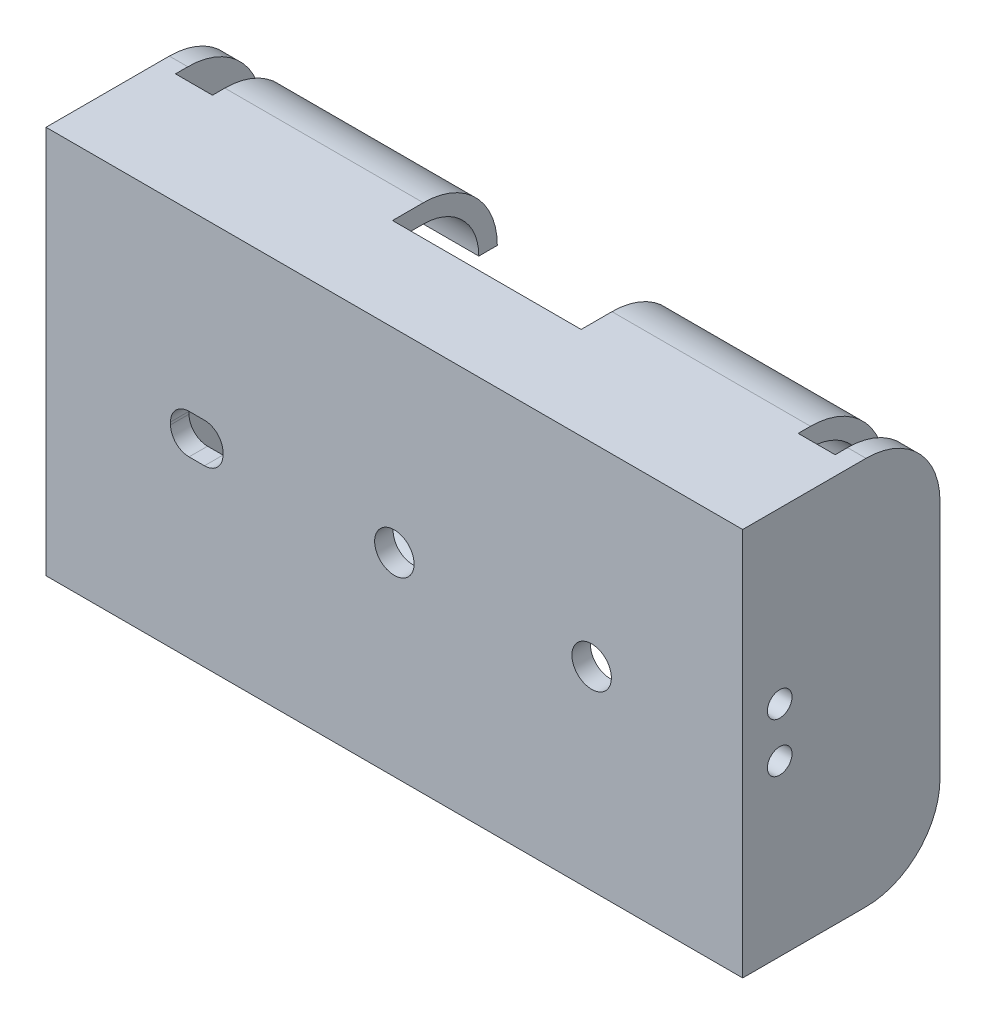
ISO-10303-21;
HEADER;
FILE_DESCRIPTION(('STEP AP214'),'2;1');
FILE_NAME('part.step','',(''),(''),'','','');
FILE_SCHEMA(('AUTOMOTIVE_DESIGN { 1 0 10303 214 1 1 1 1 }'));
ENDSEC;
DATA;
#1=APPLICATION_CONTEXT('core data for automotive mechanical design processes');
#2=APPLICATION_PROTOCOL_DEFINITION('international standard','automotive_design',2000,#1);
#3=PRODUCT_CONTEXT('',#1,'mechanical');
#4=PRODUCT('Part','Part','',(#3));
#5=PRODUCT_RELATED_PRODUCT_CATEGORY('part','',(#4));
#6=PRODUCT_DEFINITION_FORMATION('','',#4);
#7=PRODUCT_DEFINITION_CONTEXT('part definition',#1,'design');
#8=PRODUCT_DEFINITION('design','',#6,#7);
#9=PRODUCT_DEFINITION_SHAPE('','',#8);
#10=(LENGTH_UNIT() NAMED_UNIT(*) SI_UNIT(.MILLI.,.METRE.));
#11=(NAMED_UNIT(*) PLANE_ANGLE_UNIT() SI_UNIT($,.RADIAN.));
#12=(NAMED_UNIT(*) SI_UNIT($,.STERADIAN.) SOLID_ANGLE_UNIT());
#13=UNCERTAINTY_MEASURE_WITH_UNIT(LENGTH_MEASURE(1.E-05),#10,'distance_accuracy_value','');
#14=(GEOMETRIC_REPRESENTATION_CONTEXT(3) GLOBAL_UNCERTAINTY_ASSIGNED_CONTEXT((#13)) GLOBAL_UNIT_ASSIGNED_CONTEXT((#10,
#11,#12)) REPRESENTATION_CONTEXT('',''));
#15=CARTESIAN_POINT('',(0.,0.,0.));
#16=DIRECTION('',(0.,0.,1.));
#17=DIRECTION('',(1.,0.,0.));
#18=AXIS2_PLACEMENT_3D('',#15,#16,#17);
#19=CARTESIAN_POINT('',(-28.25,-9.75,-10.));
#20=DIRECTION('',(-1.,0.,0.));
#21=DIRECTION('',(0.,0.,1.));
#22=AXIS2_PLACEMENT_3D('',#19,#20,#21);
#23=CYLINDRICAL_SURFACE('',#22,6.);
#24=CARTESIAN_POINT('',(26.75,-9.75,-10.));
#25=DIRECTION('',(1.,0.,0.));
#26=DIRECTION('',(0.,0.,-1.));
#27=AXIS2_PLACEMENT_3D('',#24,#25,#26);
#28=CIRCLE('',#27,6.);
#29=CARTESIAN_POINT('',(26.75,-9.75,-16.));
#30=VERTEX_POINT('',#29);
#31=CARTESIAN_POINT('',(26.75,-15.75,-10.));
#32=VERTEX_POINT('',#31);
#33=EDGE_CURVE('E391',#30,#32,#28,.F.);
#34=ORIENTED_EDGE('',*,*,#33,.F.);
#35=DIRECTION('',(1.,0.,0.));
#36=VECTOR('',#35,1.);
#37=CARTESIAN_POINT('',(-28.25,-9.75,-16.));
#38=LINE('',#37,#36);
#39=CARTESIAN_POINT('',(28.25,-9.75,-16.));
#40=VERTEX_POINT('',#39);
#41=EDGE_CURVE('E669',#40,#30,#38,.F.);
#42=ORIENTED_EDGE('',*,*,#41,.F.);
#43=CARTESIAN_POINT('',(28.25,-9.75,-10.));
#44=DIRECTION('',(1.,0.,0.));
#45=DIRECTION('',(0.,0.,-1.));
#46=AXIS2_PLACEMENT_3D('',#43,#44,#45);
#47=CIRCLE('',#46,6.);
#48=CARTESIAN_POINT('',(28.25,-15.75,-10.));
#49=VERTEX_POINT('',#48);
#50=EDGE_CURVE('E662',#49,#40,#47,.T.);
#51=ORIENTED_EDGE('',*,*,#50,.F.);
#52=DIRECTION('',(1.,0.,0.));
#53=VECTOR('',#52,1.);
#54=CARTESIAN_POINT('',(28.25,-15.75,-10.));
#55=LINE('',#54,#53);
#56=EDGE_CURVE('E650',#32,#49,#55,.T.);
#57=ORIENTED_EDGE('',*,*,#56,.F.);
#58=EDGE_LOOP('',(#34,#42,#51,#57));
#59=FACE_BOUND('',#58,.T.);
#60=ADVANCED_FACE('F33',(#59),#23,.T.);
#61=CARTESIAN_POINT('',(-28.25,9.75,-10.));
#62=DIRECTION('',(1.,0.,0.));
#63=DIRECTION('',(0.,0.,-1.));
#64=AXIS2_PLACEMENT_3D('',#61,#62,#63);
#65=CYLINDRICAL_SURFACE('',#64,6.);
#66=CARTESIAN_POINT('',(26.75,9.75,-10.));
#67=DIRECTION('',(1.,0.,0.));
#68=DIRECTION('',(0.,0.,-1.));
#69=AXIS2_PLACEMENT_3D('',#66,#67,#68);
#70=CIRCLE('',#69,6.);
#71=CARTESIAN_POINT('',(26.75,15.75,-10.));
#72=VERTEX_POINT('',#71);
#73=CARTESIAN_POINT('',(26.75,9.75,-16.));
#74=VERTEX_POINT('',#73);
#75=EDGE_CURVE('E393',#72,#74,#70,.F.);
#76=ORIENTED_EDGE('',*,*,#75,.F.);
#77=DIRECTION('',(-1.,0.,0.));
#78=VECTOR('',#77,1.);
#79=CARTESIAN_POINT('',(-28.25,15.75,-10.));
#80=LINE('',#79,#78);
#81=CARTESIAN_POINT('',(28.25,15.75,-10.));
#82=VERTEX_POINT('',#81);
#83=EDGE_CURVE('E677',#82,#72,#80,.T.);
#84=ORIENTED_EDGE('',*,*,#83,.F.);
#85=CARTESIAN_POINT('',(28.25,9.75,-10.));
#86=DIRECTION('',(1.,0.,0.));
#87=DIRECTION('',(0.,0.,-1.));
#88=AXIS2_PLACEMENT_3D('',#85,#86,#87);
#89=CIRCLE('',#88,6.);
#90=CARTESIAN_POINT('',(28.25,9.75,-16.));
#91=VERTEX_POINT('',#90);
#92=EDGE_CURVE('E659',#91,#82,#89,.T.);
#93=ORIENTED_EDGE('',*,*,#92,.F.);
#94=DIRECTION('',(-1.,0.,0.));
#95=VECTOR('',#94,1.);
#96=CARTESIAN_POINT('',(28.25,9.75,-16.));
#97=LINE('',#96,#95);
#98=EDGE_CURVE('E664',#74,#91,#97,.F.);
#99=ORIENTED_EDGE('',*,*,#98,.F.);
#100=EDGE_LOOP('',(#76,#84,#93,#99));
#101=FACE_BOUND('',#100,.T.);
#102=ADVANCED_FACE('F740',(#101),#65,.T.);
#103=CARTESIAN_POINT('',(-7.65,-9.75,-10.));
#104=DIRECTION('',(-1.,0.,0.));
#105=DIRECTION('',(0.,0.,1.));
#106=AXIS2_PLACEMENT_3D('',#103,#104,#105);
#107=CIRCLE('',#106,6.);
#108=CARTESIAN_POINT('',(-7.65,-15.75,-10.));
#109=VERTEX_POINT('',#108);
#110=CARTESIAN_POINT('',(-7.65,-9.75,-16.));
#111=VERTEX_POINT('',#110);
#112=EDGE_CURVE('E458',#109,#111,#107,.F.);
#113=ORIENTED_EDGE('',*,*,#112,.F.);
#114=CARTESIAN_POINT('',(-23.75,-15.75,-10.));
#115=VERTEX_POINT('',#114);
#116=EDGE_CURVE('E660',#115,#109,#55,.T.);
#117=ORIENTED_EDGE('',*,*,#116,.F.);
#118=CARTESIAN_POINT('',(-23.75,-9.75,-10.));
#119=DIRECTION('',(1.,0.,0.));
#120=DIRECTION('',(0.,0.,-1.));
#121=AXIS2_PLACEMENT_3D('',#118,#119,#120);
#122=CIRCLE('',#121,6.);
#123=CARTESIAN_POINT('',(-23.75,-9.75,-16.));
#124=VERTEX_POINT('',#123);
#125=EDGE_CURVE('E509',#124,#115,#122,.F.);
#126=ORIENTED_EDGE('',*,*,#125,.F.);
#127=DIRECTION('',(1.,0.,0.));
#128=VECTOR('',#127,1.);
#129=CARTESIAN_POINT('',(-28.25,-9.75,-16.));
#130=LINE('',#129,#128);
#131=EDGE_CURVE('E540',#111,#124,#130,.F.);
#132=ORIENTED_EDGE('',*,*,#131,.F.);
#133=EDGE_LOOP('',(#113,#117,#126,#132));
#134=FACE_BOUND('',#133,.T.);
#135=ADVANCED_FACE('F799',(#134),#23,.T.);
#136=CARTESIAN_POINT('',(-7.65,9.75,-10.));
#137=DIRECTION('',(-1.,0.,0.));
#138=DIRECTION('',(0.,0.,1.));
#139=AXIS2_PLACEMENT_3D('',#136,#137,#138);
#140=CIRCLE('',#139,6.);
#141=CARTESIAN_POINT('',(-7.65,9.75,-16.));
#142=VERTEX_POINT('',#141);
#143=CARTESIAN_POINT('',(-7.65,15.75,-10.));
#144=VERTEX_POINT('',#143);
#145=EDGE_CURVE('E447',#142,#144,#140,.F.);
#146=ORIENTED_EDGE('',*,*,#145,.F.);
#147=DIRECTION('',(-1.,0.,0.));
#148=VECTOR('',#147,1.);
#149=CARTESIAN_POINT('',(28.25,9.75,-16.));
#150=LINE('',#149,#148);
#151=CARTESIAN_POINT('',(-23.75,9.75,-16.));
#152=VERTEX_POINT('',#151);
#153=EDGE_CURVE('E537',#152,#142,#150,.F.);
#154=ORIENTED_EDGE('',*,*,#153,.F.);
#155=CARTESIAN_POINT('',(-23.75,9.75,-10.));
#156=DIRECTION('',(1.,0.,0.));
#157=DIRECTION('',(0.,0.,-1.));
#158=AXIS2_PLACEMENT_3D('',#155,#156,#157);
#159=CIRCLE('',#158,6.);
#160=CARTESIAN_POINT('',(-23.75,15.75,-10.));
#161=VERTEX_POINT('',#160);
#162=EDGE_CURVE('E498',#161,#152,#159,.F.);
#163=ORIENTED_EDGE('',*,*,#162,.F.);
#164=EDGE_CURVE('E843',#144,#161,#80,.T.);
#165=ORIENTED_EDGE('',*,*,#164,.F.);
#166=EDGE_LOOP('',(#146,#154,#163,#165));
#167=FACE_BOUND('',#166,.T.);
#168=ADVANCED_FACE('F853',(#167),#65,.T.);
#169=CARTESIAN_POINT('',(28.25,9.75,-16.));
#170=DIRECTION('',(0.,1.,0.));
#171=DIRECTION('',(-1.,0.,0.));
#172=AXIS2_PLACEMENT_3D('',#169,#170,#171);
#173=PLANE('',#172);
#174=ORIENTED_EDGE('',*,*,#153,.T.);
#175=DIRECTION('',(0.,0.,1.));
#176=VECTOR('',#175,1.);
#177=CARTESIAN_POINT('',(-7.65,9.75,-16.));
#178=LINE('',#177,#176);
#179=CARTESIAN_POINT('',(-7.65,9.75,-14.5));
#180=VERTEX_POINT('',#179);
#181=EDGE_CURVE('E444',#142,#180,#178,.T.);
#182=ORIENTED_EDGE('',*,*,#181,.T.);
#183=DIRECTION('',(1.,0.,0.));
#184=VECTOR('',#183,1.);
#185=CARTESIAN_POINT('',(-0.0001,9.75,-14.5));
#186=LINE('',#185,#184);
#187=CARTESIAN_POINT('',(-23.75,9.75,-14.5));
#188=VERTEX_POINT('',#187);
#189=EDGE_CURVE('E575',#188,#180,#186,.T.);
#190=ORIENTED_EDGE('',*,*,#189,.F.);
#191=DIRECTION('',(0.,0.,-1.));
#192=VECTOR('',#191,1.);
#193=CARTESIAN_POINT('',(-23.75,9.75,-16.));
#194=LINE('',#193,#192);
#195=EDGE_CURVE('E495',#188,#152,#194,.T.);
#196=ORIENTED_EDGE('',*,*,#195,.T.);
#197=EDGE_LOOP('',(#174,#182,#190,#196));
#198=FACE_BOUND('',#197,.T.);
#199=ADVANCED_FACE('F855',(#198),#173,.F.);
#200=CARTESIAN_POINT('',(-28.25,-9.75,-16.));
#201=DIRECTION('',(0.,-1.,0.));
#202=DIRECTION('',(1.,0.,0.));
#203=AXIS2_PLACEMENT_3D('',#200,#201,#202);
#204=PLANE('',#203);
#205=DIRECTION('',(-1.,0.,0.));
#206=VECTOR('',#205,1.);
#207=CARTESIAN_POINT('',(7.07106781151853E-05,-9.75,-14.5));
#208=LINE('',#207,#206);
#209=CARTESIAN_POINT('',(-7.65,-9.75,-14.5));
#210=VERTEX_POINT('',#209);
#211=CARTESIAN_POINT('',(-23.75,-9.75,-14.5));
#212=VERTEX_POINT('',#211);
#213=EDGE_CURVE('E559',#210,#212,#208,.T.);
#214=ORIENTED_EDGE('',*,*,#213,.F.);
#215=DIRECTION('',(0.,0.,-1.));
#216=VECTOR('',#215,1.);
#217=CARTESIAN_POINT('',(-7.65,-9.75,-16.));
#218=LINE('',#217,#216);
#219=EDGE_CURVE('E455',#210,#111,#218,.T.);
#220=ORIENTED_EDGE('',*,*,#219,.T.);
#221=ORIENTED_EDGE('',*,*,#131,.T.);
#222=DIRECTION('',(0.,0.,1.));
#223=VECTOR('',#222,1.);
#224=CARTESIAN_POINT('',(-23.75,-9.75,-16.));
#225=LINE('',#224,#223);
#226=EDGE_CURVE('E506',#124,#212,#225,.T.);
#227=ORIENTED_EDGE('',*,*,#226,.T.);
#228=EDGE_LOOP('',(#214,#220,#221,#227));
#229=FACE_BOUND('',#228,.T.);
#230=ADVANCED_FACE('F903',(#229),#204,.F.);
#231=CARTESIAN_POINT('',(-28.25,-9.75,-10.));
#232=DIRECTION('',(-1.,0.,0.));
#233=DIRECTION('',(0.,0.,1.));
#234=AXIS2_PLACEMENT_3D('',#231,#232,#233);
#235=CYLINDRICAL_SURFACE('',#234,4.5);
#236=DIRECTION('',(1.,0.,0.));
#237=VECTOR('',#236,1.);
#238=CARTESIAN_POINT('',(-28.25,-14.25,-10.));
#239=LINE('',#238,#237);
#240=CARTESIAN_POINT('',(-23.75,-14.25,-10.));
#241=VERTEX_POINT('',#240);
#242=CARTESIAN_POINT('',(-7.65,-14.25,-10.));
#243=VERTEX_POINT('',#242);
#244=EDGE_CURVE('E568',#241,#243,#239,.T.);
#245=ORIENTED_EDGE('',*,*,#244,.T.);
#246=CARTESIAN_POINT('',(-7.65,-9.75,-10.));
#247=DIRECTION('',(-1.,0.,0.));
#248=DIRECTION('',(0.,0.,1.));
#249=AXIS2_PLACEMENT_3D('',#246,#247,#248);
#250=CIRCLE('',#249,4.5);
#251=EDGE_CURVE('E449',#243,#210,#250,.F.);
#252=ORIENTED_EDGE('',*,*,#251,.T.);
#253=ORIENTED_EDGE('',*,*,#213,.T.);
#254=CARTESIAN_POINT('',(-23.75,-9.75,-10.));
#255=DIRECTION('',(1.,0.,0.));
#256=DIRECTION('',(0.,0.,-1.));
#257=AXIS2_PLACEMENT_3D('',#254,#255,#256);
#258=CIRCLE('',#257,4.5);
#259=EDGE_CURVE('E500',#212,#241,#258,.F.);
#260=ORIENTED_EDGE('',*,*,#259,.T.);
#261=EDGE_LOOP('',(#245,#252,#253,#260));
#262=FACE_BOUND('',#261,.T.);
#263=ADVANCED_FACE('F898',(#262),#235,.F.);
#264=CARTESIAN_POINT('',(-28.25,9.75,-10.));
#265=DIRECTION('',(1.,0.,0.));
#266=DIRECTION('',(0.,0.,-1.));
#267=AXIS2_PLACEMENT_3D('',#264,#265,#266);
#268=CYLINDRICAL_SURFACE('',#267,4.5);
#269=ORIENTED_EDGE('',*,*,#189,.T.);
#270=CARTESIAN_POINT('',(-7.65,9.75,-10.));
#271=DIRECTION('',(-1.,0.,0.));
#272=DIRECTION('',(0.,0.,1.));
#273=AXIS2_PLACEMENT_3D('',#270,#271,#272);
#274=CIRCLE('',#273,4.5);
#275=CARTESIAN_POINT('',(-7.65,14.25,-10.));
#276=VERTEX_POINT('',#275);
#277=EDGE_CURVE('E689',#180,#276,#274,.F.);
#278=ORIENTED_EDGE('',*,*,#277,.T.);
#279=DIRECTION('',(1.,0.,0.));
#280=VECTOR('',#279,1.);
#281=CARTESIAN_POINT('',(-28.25,14.25,-10.));
#282=LINE('',#281,#280);
#283=CARTESIAN_POINT('',(-23.75,14.25,-10.));
#284=VERTEX_POINT('',#283);
#285=EDGE_CURVE('E544',#276,#284,#282,.F.);
#286=ORIENTED_EDGE('',*,*,#285,.T.);
#287=CARTESIAN_POINT('',(-23.75,9.75,-10.));
#288=DIRECTION('',(1.,0.,0.));
#289=DIRECTION('',(0.,0.,-1.));
#290=AXIS2_PLACEMENT_3D('',#287,#288,#289);
#291=CIRCLE('',#290,4.5);
#292=EDGE_CURVE('E679',#284,#188,#291,.F.);
#293=ORIENTED_EDGE('',*,*,#292,.T.);
#294=EDGE_LOOP('',(#269,#278,#286,#293));
#295=FACE_BOUND('',#294,.T.);
#296=ADVANCED_FACE('F859',(#295),#268,.F.);
#297=CARTESIAN_POINT('',(23.75,-9.75,-10.));
#298=DIRECTION('',(-1.,0.,0.));
#299=DIRECTION('',(0.,0.,1.));
#300=AXIS2_PLACEMENT_3D('',#297,#298,#299);
#301=CIRCLE('',#300,6.);
#302=CARTESIAN_POINT('',(23.75,-15.75,-10.));
#303=VERTEX_POINT('',#302);
#304=CARTESIAN_POINT('',(23.75,-9.75,-16.));
#305=VERTEX_POINT('',#304);
#306=EDGE_CURVE('E389',#303,#305,#301,.F.);
#307=ORIENTED_EDGE('',*,*,#306,.F.);
#308=CARTESIAN_POINT('',(7.65,-15.75,-10.));
#309=VERTEX_POINT('',#308);
#310=EDGE_CURVE('E729',#309,#303,#55,.T.);
#311=ORIENTED_EDGE('',*,*,#310,.F.);
#312=CARTESIAN_POINT('',(7.65,-9.75,-10.));
#313=DIRECTION('',(1.,0.,0.));
#314=DIRECTION('',(0.,0.,-1.));
#315=AXIS2_PLACEMENT_3D('',#312,#313,#314);
#316=CIRCLE('',#315,6.);
#317=CARTESIAN_POINT('',(7.65,-9.75,-16.));
#318=VERTEX_POINT('',#317);
#319=EDGE_CURVE('E439',#318,#309,#316,.F.);
#320=ORIENTED_EDGE('',*,*,#319,.F.);
#321=EDGE_CURVE('E542',#305,#318,#130,.F.);
#322=ORIENTED_EDGE('',*,*,#321,.F.);
#323=EDGE_LOOP('',(#307,#311,#320,#322));
#324=FACE_BOUND('',#323,.T.);
#325=ADVANCED_FACE('F807',(#324),#23,.T.);
#326=CARTESIAN_POINT('',(23.75,9.75,-10.));
#327=DIRECTION('',(-1.,0.,0.));
#328=DIRECTION('',(0.,0.,1.));
#329=AXIS2_PLACEMENT_3D('',#326,#327,#328);
#330=CIRCLE('',#329,6.);
#331=CARTESIAN_POINT('',(23.75,9.75,-16.));
#332=VERTEX_POINT('',#331);
#333=CARTESIAN_POINT('',(23.75,15.75,-10.));
#334=VERTEX_POINT('',#333);
#335=EDGE_CURVE('E355',#332,#334,#330,.F.);
#336=ORIENTED_EDGE('',*,*,#335,.F.);
#337=CARTESIAN_POINT('',(7.65,9.75,-16.));
#338=VERTEX_POINT('',#337);
#339=EDGE_CURVE('E541',#338,#332,#150,.F.);
#340=ORIENTED_EDGE('',*,*,#339,.F.);
#341=CARTESIAN_POINT('',(7.65,9.75,-10.));
#342=DIRECTION('',(1.,0.,0.));
#343=DIRECTION('',(0.,0.,-1.));
#344=AXIS2_PLACEMENT_3D('',#341,#342,#343);
#345=CIRCLE('',#344,6.);
#346=CARTESIAN_POINT('',(7.65,15.75,-10.));
#347=VERTEX_POINT('',#346);
#348=EDGE_CURVE('E428',#347,#338,#345,.F.);
#349=ORIENTED_EDGE('',*,*,#348,.F.);
#350=EDGE_CURVE('E680',#334,#347,#80,.T.);
#351=ORIENTED_EDGE('',*,*,#350,.F.);
#352=EDGE_LOOP('',(#336,#340,#349,#351));
#353=FACE_BOUND('',#352,.T.);
#354=ADVANCED_FACE('F841',(#353),#65,.T.);
#355=CARTESIAN_POINT('',(16.,0.,-16.));
#356=DIRECTION('',(0.,0.,1.));
#357=DIRECTION('',(1.,0.,0.));
#358=AXIS2_PLACEMENT_3D('',#355,#356,#357);
#359=CYLINDRICAL_SURFACE('',#358,1.6);
#360=CARTESIAN_POINT('',(16.,0.,0.));
#361=DIRECTION('',(0.,0.,1.));
#362=DIRECTION('',(1.,0.,0.));
#363=AXIS2_PLACEMENT_3D('',#360,#361,#362);
#364=CIRCLE('',#363,1.6);
#365=CARTESIAN_POINT('',(17.6,0.,0.));
#366=VERTEX_POINT('',#365);
#367=EDGE_CURVE('E613',#366,#366,#364,.T.);
#368=ORIENTED_EDGE('',*,*,#367,.T.);
#369=EDGE_LOOP('',(#368));
#370=FACE_BOUND('',#369,.T.);
#371=CARTESIAN_POINT('',(16.,0.,-1.5));
#372=DIRECTION('',(0.,0.,-1.));
#373=DIRECTION('',(-1.,0.,0.));
#374=AXIS2_PLACEMENT_3D('',#371,#372,#373);
#375=CIRCLE('',#374,1.6);
#376=CARTESIAN_POINT('',(14.4,0.,-1.5));
#377=VERTEX_POINT('',#376);
#378=EDGE_CURVE('E533',#377,#377,#375,.F.);
#379=ORIENTED_EDGE('',*,*,#378,.F.);
#380=EDGE_LOOP('',(#379));
#381=FACE_BOUND('',#380,.T.);
#382=ADVANCED_FACE('F897',(#370,#381),#359,.F.);
#383=CARTESIAN_POINT('',(-16.65,0.0999999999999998,-16.));
#384=DIRECTION('',(0.,0.,1.));
#385=DIRECTION('',(1.,0.,0.));
#386=AXIS2_PLACEMENT_3D('',#383,#384,#385);
#387=CYLINDRICAL_SURFACE('',#386,1.5);
#388=CARTESIAN_POINT('',(-16.65,0.0999999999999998,-1.5));
#389=DIRECTION('',(0.,0.,-1.));
#390=DIRECTION('',(-1.,0.,0.));
#391=AXIS2_PLACEMENT_3D('',#388,#389,#390);
#392=CIRCLE('',#391,1.5);
#393=CARTESIAN_POINT('',(-16.65,1.6,-1.5));
#394=VERTEX_POINT('',#393);
#395=CARTESIAN_POINT('',(-18.15,0.0999999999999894,-1.5));
#396=VERTEX_POINT('',#395);
#397=EDGE_CURVE('E531',#394,#396,#392,.F.);
#398=ORIENTED_EDGE('',*,*,#397,.F.);
#399=DIRECTION('',(0.,0.,1.));
#400=VECTOR('',#399,1.);
#401=CARTESIAN_POINT('',(-16.65,1.6,-16.));
#402=LINE('',#401,#400);
#403=CARTESIAN_POINT('',(-16.65,1.6,0.));
#404=VERTEX_POINT('',#403);
#405=EDGE_CURVE('E611',#394,#404,#402,.T.);
#406=ORIENTED_EDGE('',*,*,#405,.T.);
#407=CARTESIAN_POINT('',(-16.65,0.0999999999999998,0.));
#408=DIRECTION('',(0.,0.,1.));
#409=DIRECTION('',(-1.,0.,0.));
#410=AXIS2_PLACEMENT_3D('',#407,#408,#409);
#411=CIRCLE('',#410,1.5);
#412=CARTESIAN_POINT('',(-18.15,0.099999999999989,0.));
#413=VERTEX_POINT('',#412);
#414=EDGE_CURVE('E586',#404,#413,#411,.T.);
#415=ORIENTED_EDGE('',*,*,#414,.T.);
#416=DIRECTION('',(0.,0.,1.));
#417=VECTOR('',#416,1.);
#418=CARTESIAN_POINT('',(-18.15,0.0999999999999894,-16.));
#419=LINE('',#418,#417);
#420=EDGE_CURVE('E610',#396,#413,#419,.T.);
#421=ORIENTED_EDGE('',*,*,#420,.F.);
#422=EDGE_LOOP('',(#398,#406,#415,#421));
#423=FACE_BOUND('',#422,.T.);
#424=ADVANCED_FACE('F1259',(#423),#387,.F.);
#425=CARTESIAN_POINT('',(-16.65,1.6,-16.));
#426=DIRECTION('',(0.,1.,0.));
#427=DIRECTION('',(0.,0.,1.));
#428=AXIS2_PLACEMENT_3D('',#425,#426,#427);
#429=PLANE('',#428);
#430=DIRECTION('',(-1.,0.,0.));
#431=VECTOR('',#430,1.);
#432=CARTESIAN_POINT('',(-16.65,1.6,-1.5));
#433=LINE('',#432,#431);
#434=CARTESIAN_POINT('',(-15.4,1.6,-1.5));
#435=VERTEX_POINT('',#434);
#436=EDGE_CURVE('E529',#435,#394,#433,.T.);
#437=ORIENTED_EDGE('',*,*,#436,.F.);
#438=DIRECTION('',(0.,0.,1.));
#439=VECTOR('',#438,1.);
#440=CARTESIAN_POINT('',(-15.4,1.6,-16.));
#441=LINE('',#440,#439);
#442=CARTESIAN_POINT('',(-15.4,1.6,0.));
#443=VERTEX_POINT('',#442);
#444=EDGE_CURVE('E614',#435,#443,#441,.T.);
#445=ORIENTED_EDGE('',*,*,#444,.T.);
#446=DIRECTION('',(-1.,0.,0.));
#447=VECTOR('',#446,1.);
#448=CARTESIAN_POINT('',(-16.65,1.6,0.));
#449=LINE('',#448,#447);
#450=EDGE_CURVE('E607',#443,#404,#449,.T.);
#451=ORIENTED_EDGE('',*,*,#450,.T.);
#452=ORIENTED_EDGE('',*,*,#405,.F.);
#453=EDGE_LOOP('',(#437,#445,#451,#452));
#454=FACE_BOUND('',#453,.T.);
#455=ADVANCED_FACE('F1249',(#454),#429,.F.);
#456=CARTESIAN_POINT('',(-15.4,0.0999999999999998,-16.));
#457=DIRECTION('',(0.,0.,1.));
#458=DIRECTION('',(1.,0.,0.));
#459=AXIS2_PLACEMENT_3D('',#456,#457,#458);
#460=CYLINDRICAL_SURFACE('',#459,1.5);
#461=CARTESIAN_POINT('',(-15.4,0.0999999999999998,-1.5));
#462=DIRECTION('',(0.,0.,-1.));
#463=DIRECTION('',(-1.,0.,0.));
#464=AXIS2_PLACEMENT_3D('',#461,#462,#463);
#465=CIRCLE('',#464,1.5);
#466=CARTESIAN_POINT('',(-13.9,0.0999999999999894,-1.5));
#467=VERTEX_POINT('',#466);
#468=EDGE_CURVE('E527',#467,#435,#465,.F.);
#469=ORIENTED_EDGE('',*,*,#468,.F.);
#470=DIRECTION('',(0.,0.,1.));
#471=VECTOR('',#470,1.);
#472=CARTESIAN_POINT('',(-13.9,0.0999999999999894,-16.));
#473=LINE('',#472,#471);
#474=CARTESIAN_POINT('',(-13.9,0.0999999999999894,0.));
#475=VERTEX_POINT('',#474);
#476=EDGE_CURVE('E616',#467,#475,#473,.T.);
#477=ORIENTED_EDGE('',*,*,#476,.T.);
#478=CARTESIAN_POINT('',(-15.4,0.0999999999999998,0.));
#479=DIRECTION('',(0.,0.,1.));
#480=DIRECTION('',(1.,0.,0.));
#481=AXIS2_PLACEMENT_3D('',#478,#479,#480);
#482=CIRCLE('',#481,1.5);
#483=EDGE_CURVE('E604',#475,#443,#482,.T.);
#484=ORIENTED_EDGE('',*,*,#483,.T.);
#485=ORIENTED_EDGE('',*,*,#444,.F.);
#486=EDGE_LOOP('',(#469,#477,#484,#485));
#487=FACE_BOUND('',#486,.T.);
#488=ADVANCED_FACE('F1239',(#487),#460,.F.);
#489=CARTESIAN_POINT('',(-13.9,0.0999999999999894,-16.));
#490=DIRECTION('',(1.,0.,0.));
#491=DIRECTION('',(0.,0.,-1.));
#492=AXIS2_PLACEMENT_3D('',#489,#490,#491);
#493=PLANE('',#492);
#494=DIRECTION('',(0.,1.,0.));
#495=VECTOR('',#494,1.);
#496=CARTESIAN_POINT('',(-13.9,0.0999999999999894,-1.5));
#497=LINE('',#496,#495);
#498=CARTESIAN_POINT('',(-13.9,-0.0999999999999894,-1.5));
#499=VERTEX_POINT('',#498);
#500=EDGE_CURVE('E525',#499,#467,#497,.T.);
#501=ORIENTED_EDGE('',*,*,#500,.F.);
#502=DIRECTION('',(0.,0.,1.));
#503=VECTOR('',#502,1.);
#504=CARTESIAN_POINT('',(-13.9,-0.0999999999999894,-16.));
#505=LINE('',#504,#503);
#506=CARTESIAN_POINT('',(-13.9,-0.0999999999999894,0.));
#507=VERTEX_POINT('',#506);
#508=EDGE_CURVE('E618',#499,#507,#505,.T.);
#509=ORIENTED_EDGE('',*,*,#508,.T.);
#510=DIRECTION('',(0.,1.,0.));
#511=VECTOR('',#510,1.);
#512=CARTESIAN_POINT('',(-13.9,0.0999999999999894,0.));
#513=LINE('',#512,#511);
#514=EDGE_CURVE('E601',#507,#475,#513,.T.);
#515=ORIENTED_EDGE('',*,*,#514,.T.);
#516=ORIENTED_EDGE('',*,*,#476,.F.);
#517=EDGE_LOOP('',(#501,#509,#515,#516));
#518=FACE_BOUND('',#517,.T.);
#519=ADVANCED_FACE('F1229',(#518),#493,.F.);
#520=CARTESIAN_POINT('',(-15.4,-0.0999999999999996,-16.));
#521=DIRECTION('',(0.,0.,1.));
#522=DIRECTION('',(1.,0.,0.));
#523=AXIS2_PLACEMENT_3D('',#520,#521,#522);
#524=CYLINDRICAL_SURFACE('',#523,1.5);
#525=CARTESIAN_POINT('',(-15.4,-0.0999999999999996,-1.5));
#526=DIRECTION('',(0.,0.,-1.));
#527=DIRECTION('',(-1.,0.,0.));
#528=AXIS2_PLACEMENT_3D('',#525,#526,#527);
#529=CIRCLE('',#528,1.5);
#530=CARTESIAN_POINT('',(-15.4,-1.6,-1.5));
#531=VERTEX_POINT('',#530);
#532=EDGE_CURVE('E523',#531,#499,#529,.F.);
#533=ORIENTED_EDGE('',*,*,#532,.F.);
#534=DIRECTION('',(0.,0.,1.));
#535=VECTOR('',#534,1.);
#536=CARTESIAN_POINT('',(-15.4,-1.6,-16.));
#537=LINE('',#536,#535);
#538=CARTESIAN_POINT('',(-15.4,-1.6,0.));
#539=VERTEX_POINT('',#538);
#540=EDGE_CURVE('E620',#531,#539,#537,.T.);
#541=ORIENTED_EDGE('',*,*,#540,.T.);
#542=CARTESIAN_POINT('',(-15.4,-0.0999999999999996,0.));
#543=DIRECTION('',(0.,0.,1.));
#544=DIRECTION('',(-1.,0.,0.));
#545=AXIS2_PLACEMENT_3D('',#542,#543,#544);
#546=CIRCLE('',#545,1.5);
#547=EDGE_CURVE('E598',#539,#507,#546,.T.);
#548=ORIENTED_EDGE('',*,*,#547,.T.);
#549=ORIENTED_EDGE('',*,*,#508,.F.);
#550=EDGE_LOOP('',(#533,#541,#548,#549));
#551=FACE_BOUND('',#550,.T.);
#552=ADVANCED_FACE('F1219',(#551),#524,.F.);
#553=CARTESIAN_POINT('',(-16.65,-1.6,-16.));
#554=DIRECTION('',(0.,-1.,0.));
#555=DIRECTION('',(0.,0.,-1.));
#556=AXIS2_PLACEMENT_3D('',#553,#554,#555);
#557=PLANE('',#556);
#558=DIRECTION('',(1.,0.,0.));
#559=VECTOR('',#558,1.);
#560=CARTESIAN_POINT('',(-16.65,-1.6,-1.5));
#561=LINE('',#560,#559);
#562=CARTESIAN_POINT('',(-16.65,-1.6,-1.5));
#563=VERTEX_POINT('',#562);
#564=EDGE_CURVE('E521',#563,#531,#561,.T.);
#565=ORIENTED_EDGE('',*,*,#564,.F.);
#566=DIRECTION('',(0.,0.,1.));
#567=VECTOR('',#566,1.);
#568=CARTESIAN_POINT('',(-16.65,-1.6,-16.));
#569=LINE('',#568,#567);
#570=CARTESIAN_POINT('',(-16.65,-1.6,0.));
#571=VERTEX_POINT('',#570);
#572=EDGE_CURVE('E622',#563,#571,#569,.T.);
#573=ORIENTED_EDGE('',*,*,#572,.T.);
#574=DIRECTION('',(1.,0.,0.));
#575=VECTOR('',#574,1.);
#576=CARTESIAN_POINT('',(-16.65,-1.6,0.));
#577=LINE('',#576,#575);
#578=EDGE_CURVE('E595',#571,#539,#577,.T.);
#579=ORIENTED_EDGE('',*,*,#578,.T.);
#580=ORIENTED_EDGE('',*,*,#540,.F.);
#581=EDGE_LOOP('',(#565,#573,#579,#580));
#582=FACE_BOUND('',#581,.T.);
#583=ADVANCED_FACE('F1209',(#582),#557,.F.);
#584=CARTESIAN_POINT('',(-16.65,-0.0999999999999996,-16.));
#585=DIRECTION('',(0.,0.,1.));
#586=DIRECTION('',(1.,0.,0.));
#587=AXIS2_PLACEMENT_3D('',#584,#585,#586);
#588=CYLINDRICAL_SURFACE('',#587,1.5);
#589=CARTESIAN_POINT('',(-16.65,-0.0999999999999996,-1.5));
#590=DIRECTION('',(0.,0.,-1.));
#591=DIRECTION('',(-1.,0.,0.));
#592=AXIS2_PLACEMENT_3D('',#589,#590,#591);
#593=CIRCLE('',#592,1.5);
#594=CARTESIAN_POINT('',(-18.15,-0.0999999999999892,-1.5));
#595=VERTEX_POINT('',#594);
#596=EDGE_CURVE('E519',#595,#563,#593,.F.);
#597=ORIENTED_EDGE('',*,*,#596,.F.);
#598=DIRECTION('',(0.,0.,1.));
#599=VECTOR('',#598,1.);
#600=CARTESIAN_POINT('',(-18.15,-0.0999999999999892,-16.));
#601=LINE('',#600,#599);
#602=CARTESIAN_POINT('',(-18.15,-0.0999999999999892,0.));
#603=VERTEX_POINT('',#602);
#604=EDGE_CURVE('E624',#595,#603,#601,.T.);
#605=ORIENTED_EDGE('',*,*,#604,.T.);
#606=CARTESIAN_POINT('',(-16.65,-0.0999999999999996,0.));
#607=DIRECTION('',(0.,0.,1.));
#608=DIRECTION('',(-1.,0.,0.));
#609=AXIS2_PLACEMENT_3D('',#606,#607,#608);
#610=CIRCLE('',#609,1.5);
#611=EDGE_CURVE('E592',#603,#571,#610,.T.);
#612=ORIENTED_EDGE('',*,*,#611,.T.);
#613=ORIENTED_EDGE('',*,*,#572,.F.);
#614=EDGE_LOOP('',(#597,#605,#612,#613));
#615=FACE_BOUND('',#614,.T.);
#616=ADVANCED_FACE('F1199',(#615),#588,.F.);
#617=CARTESIAN_POINT('',(-18.15,0.0999999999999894,-16.));
#618=DIRECTION('',(-1.,0.,0.));
#619=DIRECTION('',(0.,0.,1.));
#620=AXIS2_PLACEMENT_3D('',#617,#618,#619);
#621=PLANE('',#620);
#622=DIRECTION('',(0.,-1.,0.));
#623=VECTOR('',#622,1.);
#624=CARTESIAN_POINT('',(-18.15,0.0999999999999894,-1.5));
#625=LINE('',#624,#623);
#626=EDGE_CURVE('E517',#396,#595,#625,.T.);
#627=ORIENTED_EDGE('',*,*,#626,.F.);
#628=ORIENTED_EDGE('',*,*,#420,.T.);
#629=DIRECTION('',(0.,-1.,0.));
#630=VECTOR('',#629,1.);
#631=CARTESIAN_POINT('',(-18.15,0.0999999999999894,0.));
#632=LINE('',#631,#630);
#633=EDGE_CURVE('E589',#413,#603,#632,.T.);
#634=ORIENTED_EDGE('',*,*,#633,.T.);
#635=ORIENTED_EDGE('',*,*,#604,.F.);
#636=EDGE_LOOP('',(#627,#628,#634,#635));
#637=FACE_BOUND('',#636,.T.);
#638=ADVANCED_FACE('F1190',(#637),#621,.F.);
#639=CARTESIAN_POINT('',(0.,0.,-16.));
#640=DIRECTION('',(0.,0.,1.));
#641=DIRECTION('',(1.,0.,0.));
#642=AXIS2_PLACEMENT_3D('',#639,#640,#641);
#643=CYLINDRICAL_SURFACE('',#642,1.6);
#644=CARTESIAN_POINT('',(0.,0.,0.));
#645=DIRECTION('',(0.,0.,1.));
#646=DIRECTION('',(1.,0.,0.));
#647=AXIS2_PLACEMENT_3D('',#644,#645,#646);
#648=CIRCLE('',#647,1.6);
#649=CARTESIAN_POINT('',(1.6,0.,0.));
#650=VERTEX_POINT('',#649);
#651=EDGE_CURVE('E578',#650,#650,#648,.T.);
#652=ORIENTED_EDGE('',*,*,#651,.T.);
#653=EDGE_LOOP('',(#652));
#654=FACE_BOUND('',#653,.T.);
#655=CARTESIAN_POINT('',(0.,0.,-1.5));
#656=DIRECTION('',(0.,0.,-1.));
#657=DIRECTION('',(-1.,0.,0.));
#658=AXIS2_PLACEMENT_3D('',#655,#656,#657);
#659=CIRCLE('',#658,1.6);
#660=CARTESIAN_POINT('',(-1.6,0.,-1.5));
#661=VERTEX_POINT('',#660);
#662=EDGE_CURVE('E514',#661,#661,#659,.F.);
#663=ORIENTED_EDGE('',*,*,#662,.F.);
#664=EDGE_LOOP('',(#663));
#665=FACE_BOUND('',#664,.T.);
#666=ADVANCED_FACE('F1182',(#654,#665),#643,.F.);
#667=CARTESIAN_POINT('',(-28.25,-15.75,-16.));
#668=DIRECTION('',(0.,0.,1.));
#669=DIRECTION('',(1.,0.,0.));
#670=AXIS2_PLACEMENT_3D('',#667,#668,#669);
#671=PLANE('',#670);
#672=ORIENTED_EDGE('',*,*,#41,.T.);
#673=DIRECTION('',(0.,1.,0.));
#674=VECTOR('',#673,1.);
#675=CARTESIAN_POINT('',(26.75,-15.75,-16.));
#676=LINE('',#675,#674);
#677=EDGE_CURVE('E548',#30,#74,#676,.T.);
#678=ORIENTED_EDGE('',*,*,#677,.T.);
#679=ORIENTED_EDGE('',*,*,#98,.T.);
#680=DIRECTION('',(0.,1.,0.));
#681=VECTOR('',#680,1.);
#682=CARTESIAN_POINT('',(28.25,15.75,-16.));
#683=LINE('',#682,#681);
#684=EDGE_CURVE('E644',#40,#91,#683,.T.);
#685=ORIENTED_EDGE('',*,*,#684,.F.);
#686=EDGE_LOOP('',(#672,#678,#679,#685));
#687=FACE_BOUND('',#686,.T.);
#688=ADVANCED_FACE('F733',(#687),#671,.F.);
#689=CARTESIAN_POINT('',(-28.25,15.75,-16.));
#690=DIRECTION('',(-1.,0.,0.));
#691=DIRECTION('',(0.,0.,1.));
#692=AXIS2_PLACEMENT_3D('',#689,#690,#691);
#693=PLANE('',#692);
#694=DIRECTION('',(0.,-1.,0.));
#695=VECTOR('',#694,1.);
#696=CARTESIAN_POINT('',(-28.25,15.75,-16.));
#697=LINE('',#696,#695);
#698=CARTESIAN_POINT('',(-28.25,9.75,-16.));
#699=VERTEX_POINT('',#698);
#700=CARTESIAN_POINT('',(-28.25,-9.75,-16.));
#701=VERTEX_POINT('',#700);
#702=EDGE_CURVE('E641',#699,#701,#697,.T.);
#703=ORIENTED_EDGE('',*,*,#702,.T.);
#704=CARTESIAN_POINT('',(-28.25,-9.75,-10.));
#705=DIRECTION('',(-1.,0.,0.));
#706=DIRECTION('',(0.,0.,1.));
#707=AXIS2_PLACEMENT_3D('',#704,#705,#706);
#708=CIRCLE('',#707,6.);
#709=CARTESIAN_POINT('',(-28.25,-15.75,-10.));
#710=VERTEX_POINT('',#709);
#711=EDGE_CURVE('E674',#701,#710,#708,.T.);
#712=ORIENTED_EDGE('',*,*,#711,.T.);
#713=DIRECTION('',(0.,0.,1.));
#714=VECTOR('',#713,1.);
#715=CARTESIAN_POINT('',(-28.25,-15.75,-16.));
#716=LINE('',#715,#714);
#717=CARTESIAN_POINT('',(-28.25,-15.75,0.));
#718=VERTEX_POINT('',#717);
#719=EDGE_CURVE('E647',#710,#718,#716,.T.);
#720=ORIENTED_EDGE('',*,*,#719,.T.);
#721=DIRECTION('',(0.,-1.,0.));
#722=VECTOR('',#721,1.);
#723=CARTESIAN_POINT('',(-28.25,15.75,0.));
#724=LINE('',#723,#722);
#725=CARTESIAN_POINT('',(-28.25,15.75,0.));
#726=VERTEX_POINT('',#725);
#727=EDGE_CURVE('E629',#726,#718,#724,.T.);
#728=ORIENTED_EDGE('',*,*,#727,.F.);
#729=DIRECTION('',(0.,0.,1.));
#730=VECTOR('',#729,1.);
#731=CARTESIAN_POINT('',(-28.25,15.75,-16.));
#732=LINE('',#731,#730);
#733=CARTESIAN_POINT('',(-28.25,15.75,-10.));
#734=VERTEX_POINT('',#733);
#735=EDGE_CURVE('E648',#734,#726,#732,.T.);
#736=ORIENTED_EDGE('',*,*,#735,.F.);
#737=CARTESIAN_POINT('',(-28.25,9.75,-10.));
#738=DIRECTION('',(-1.,0.,0.));
#739=DIRECTION('',(0.,0.,1.));
#740=AXIS2_PLACEMENT_3D('',#737,#738,#739);
#741=CIRCLE('',#740,6.);
#742=EDGE_CURVE('E672',#734,#699,#741,.T.);
#743=ORIENTED_EDGE('',*,*,#742,.T.);
#744=EDGE_LOOP('',(#703,#712,#720,#728,#736,#743));
#745=FACE_BOUND('',#744,.T.);
#746=ADVANCED_FACE('F35',(#745),#693,.T.);
#747=CARTESIAN_POINT('',(-28.25,15.75,-16.));
#748=DIRECTION('',(0.,1.,0.));
#749=DIRECTION('',(0.,0.,1.));
#750=AXIS2_PLACEMENT_3D('',#747,#748,#749);
#751=PLANE('',#750);
#752=DIRECTION('',(0.,0.,-1.));
#753=VECTOR('',#752,1.);
#754=CARTESIAN_POINT('',(26.75,15.75,-9.));
#755=LINE('',#754,#753);
#756=CARTESIAN_POINT('',(26.75,15.75,-9.));
#757=VERTEX_POINT('',#756);
#758=EDGE_CURVE('E358',#757,#72,#755,.T.);
#759=ORIENTED_EDGE('',*,*,#758,.F.);
#760=DIRECTION('',(1.,0.,0.));
#761=VECTOR('',#760,1.);
#762=CARTESIAN_POINT('',(26.75,15.75,-9.));
#763=LINE('',#762,#761);
#764=CARTESIAN_POINT('',(23.75,15.75,-9.));
#765=VERTEX_POINT('',#764);
#766=EDGE_CURVE('E344',#765,#757,#763,.T.);
#767=ORIENTED_EDGE('',*,*,#766,.F.);
#768=DIRECTION('',(0.,0.,1.));
#769=VECTOR('',#768,1.);
#770=CARTESIAN_POINT('',(23.75,15.75,-9.));
#771=LINE('',#770,#769);
#772=EDGE_CURVE('E352',#334,#765,#771,.T.);
#773=ORIENTED_EDGE('',*,*,#772,.F.);
#774=ORIENTED_EDGE('',*,*,#350,.T.);
#775=DIRECTION('',(0.,0.,-1.));
#776=VECTOR('',#775,1.);
#777=CARTESIAN_POINT('',(7.65,15.75,-7.5));
#778=LINE('',#777,#776);
#779=CARTESIAN_POINT('',(7.65,15.75,-7.5));
#780=VERTEX_POINT('',#779);
#781=EDGE_CURVE('E402',#780,#347,#778,.T.);
#782=ORIENTED_EDGE('',*,*,#781,.F.);
#783=DIRECTION('',(1.,0.,0.));
#784=VECTOR('',#783,1.);
#785=CARTESIAN_POINT('',(-7.65,15.75,-7.5));
#786=LINE('',#785,#784);
#787=CARTESIAN_POINT('',(-7.65,15.75,-7.5));
#788=VERTEX_POINT('',#787);
#789=EDGE_CURVE('E399',#788,#780,#786,.T.);
#790=ORIENTED_EDGE('',*,*,#789,.F.);
#791=DIRECTION('',(0.,0.,1.));
#792=VECTOR('',#791,1.);
#793=CARTESIAN_POINT('',(-7.65,15.75,-7.5));
#794=LINE('',#793,#792);
#795=EDGE_CURVE('E396',#144,#788,#794,.T.);
#796=ORIENTED_EDGE('',*,*,#795,.F.);
#797=ORIENTED_EDGE('',*,*,#164,.T.);
#798=DIRECTION('',(0.,0.,-1.));
#799=VECTOR('',#798,1.);
#800=CARTESIAN_POINT('',(-23.75,15.75,-9.));
#801=LINE('',#800,#799);
#802=CARTESIAN_POINT('',(-23.75,15.75,-9.));
#803=VERTEX_POINT('',#802);
#804=EDGE_CURVE('E463',#803,#161,#801,.T.);
#805=ORIENTED_EDGE('',*,*,#804,.F.);
#806=DIRECTION('',(1.,0.,0.));
#807=VECTOR('',#806,1.);
#808=CARTESIAN_POINT('',(-26.75,15.75,-9.));
#809=LINE('',#808,#807);
#810=CARTESIAN_POINT('',(-26.75,15.75,-9.));
#811=VERTEX_POINT('',#810);
#812=EDGE_CURVE('E469',#811,#803,#809,.T.);
#813=ORIENTED_EDGE('',*,*,#812,.F.);
#814=DIRECTION('',(0.,0.,1.));
#815=VECTOR('',#814,1.);
#816=CARTESIAN_POINT('',(-26.75,15.75,-9.));
#817=LINE('',#816,#815);
#818=CARTESIAN_POINT('',(-26.75,15.75,-10.));
#819=VERTEX_POINT('',#818);
#820=EDGE_CURVE('E466',#819,#811,#817,.T.);
#821=ORIENTED_EDGE('',*,*,#820,.F.);
#822=EDGE_CURVE('E676',#819,#734,#80,.T.);
#823=ORIENTED_EDGE('',*,*,#822,.T.);
#824=ORIENTED_EDGE('',*,*,#735,.T.);
#825=DIRECTION('',(-1.,0.,0.));
#826=VECTOR('',#825,1.);
#827=CARTESIAN_POINT('',(-28.25,15.75,0.));
#828=LINE('',#827,#826);
#829=CARTESIAN_POINT('',(28.25,15.75,0.));
#830=VERTEX_POINT('',#829);
#831=EDGE_CURVE('E638',#830,#726,#828,.T.);
#832=ORIENTED_EDGE('',*,*,#831,.F.);
#833=DIRECTION('',(0.,0.,1.));
#834=VECTOR('',#833,1.);
#835=CARTESIAN_POINT('',(28.25,15.75,-16.));
#836=LINE('',#835,#834);
#837=EDGE_CURVE('E651',#82,#830,#836,.T.);
#838=ORIENTED_EDGE('',*,*,#837,.F.);
#839=ORIENTED_EDGE('',*,*,#83,.T.);
#840=EDGE_LOOP('',(#759,#767,#773,#774,#782,#790,#796,#797,#805,#813,#821,#823,#824,#832,#838,#839));
#841=FACE_BOUND('',#840,.T.);
#842=ADVANCED_FACE('F360',(#841),#751,.T.);
#843=CARTESIAN_POINT('',(28.25,15.75,-16.));
#844=DIRECTION('',(1.,0.,0.));
#845=DIRECTION('',(0.,0.,-1.));
#846=AXIS2_PLACEMENT_3D('',#843,#844,#845);
#847=PLANE('',#846);
#848=CARTESIAN_POINT('',(28.25,-2.,-3.));
#849=DIRECTION('',(1.,0.,0.));
#850=DIRECTION('',(0.,0.,-1.));
#851=AXIS2_PLACEMENT_3D('',#848,#849,#850);
#852=CIRCLE('',#851,1.);
#853=CARTESIAN_POINT('',(28.25,-2.,-4.));
#854=VERTEX_POINT('',#853);
#855=EDGE_CURVE('E705',#854,#854,#852,.T.);
#856=ORIENTED_EDGE('',*,*,#855,.F.);
#857=EDGE_LOOP('',(#856));
#858=FACE_BOUND('',#857,.T.);
#859=CARTESIAN_POINT('',(28.25,2.,-3.));
#860=DIRECTION('',(1.,0.,0.));
#861=DIRECTION('',(0.,0.,-1.));
#862=AXIS2_PLACEMENT_3D('',#859,#860,#861);
#863=CIRCLE('',#862,1.);
#864=CARTESIAN_POINT('',(28.25,2.,-4.));
#865=VERTEX_POINT('',#864);
#866=EDGE_CURVE('E697',#865,#865,#863,.T.);
#867=ORIENTED_EDGE('',*,*,#866,.F.);
#868=EDGE_LOOP('',(#867));
#869=FACE_BOUND('',#868,.T.);
#870=DIRECTION('',(0.,0.,1.));
#871=VECTOR('',#870,1.);
#872=CARTESIAN_POINT('',(28.25,-15.75,-16.));
#873=LINE('',#872,#871);
#874=CARTESIAN_POINT('',(28.25,-15.75,0.));
#875=VERTEX_POINT('',#874);
#876=EDGE_CURVE('E653',#49,#875,#873,.T.);
#877=ORIENTED_EDGE('',*,*,#876,.F.);
#878=ORIENTED_EDGE('',*,*,#50,.T.);
#879=ORIENTED_EDGE('',*,*,#684,.T.);
#880=ORIENTED_EDGE('',*,*,#92,.T.);
#881=ORIENTED_EDGE('',*,*,#837,.T.);
#882=DIRECTION('',(0.,1.,0.));
#883=VECTOR('',#882,1.);
#884=CARTESIAN_POINT('',(28.25,15.75,0.));
#885=LINE('',#884,#883);
#886=EDGE_CURVE('E635',#875,#830,#885,.T.);
#887=ORIENTED_EDGE('',*,*,#886,.F.);
#888=EDGE_LOOP('',(#877,#878,#879,#880,#881,#887));
#889=FACE_BOUND('',#888,.T.);
#890=ADVANCED_FACE('F713',(#858,#869,#889),#847,.T.);
#891=CARTESIAN_POINT('',(-28.25,-15.75,-16.));
#892=DIRECTION('',(0.,-1.,0.));
#893=DIRECTION('',(0.,0.,-1.));
#894=AXIS2_PLACEMENT_3D('',#891,#892,#893);
#895=PLANE('',#894);
#896=DIRECTION('',(0.,0.,-1.));
#897=VECTOR('',#896,1.);
#898=CARTESIAN_POINT('',(26.75,-15.75,-9.));
#899=LINE('',#898,#897);
#900=CARTESIAN_POINT('',(26.75,-15.75,-9.));
#901=VERTEX_POINT('',#900);
#902=EDGE_CURVE('E362',#901,#32,#899,.T.);
#903=ORIENTED_EDGE('',*,*,#902,.T.);
#904=ORIENTED_EDGE('',*,*,#56,.T.);
#905=ORIENTED_EDGE('',*,*,#876,.T.);
#906=DIRECTION('',(1.,0.,0.));
#907=VECTOR('',#906,1.);
#908=CARTESIAN_POINT('',(-28.25,-15.75,0.));
#909=LINE('',#908,#907);
#910=EDGE_CURVE('E632',#718,#875,#909,.T.);
#911=ORIENTED_EDGE('',*,*,#910,.F.);
#912=ORIENTED_EDGE('',*,*,#719,.F.);
#913=CARTESIAN_POINT('',(-26.75,-15.75,-10.));
#914=VERTEX_POINT('',#913);
#915=EDGE_CURVE('E656',#710,#914,#55,.T.);
#916=ORIENTED_EDGE('',*,*,#915,.T.);
#917=DIRECTION('',(0.,0.,1.));
#918=VECTOR('',#917,1.);
#919=CARTESIAN_POINT('',(-26.75,-15.75,-9.));
#920=LINE('',#919,#918);
#921=CARTESIAN_POINT('',(-26.75,-15.75,-9.));
#922=VERTEX_POINT('',#921);
#923=EDGE_CURVE('E475',#914,#922,#920,.T.);
#924=ORIENTED_EDGE('',*,*,#923,.T.);
#925=DIRECTION('',(1.,0.,0.));
#926=VECTOR('',#925,1.);
#927=CARTESIAN_POINT('',(-26.75,-15.75,-9.));
#928=LINE('',#927,#926);
#929=CARTESIAN_POINT('',(-23.75,-15.75,-9.));
#930=VERTEX_POINT('',#929);
#931=EDGE_CURVE('E478',#922,#930,#928,.T.);
#932=ORIENTED_EDGE('',*,*,#931,.T.);
#933=DIRECTION('',(0.,0.,-1.));
#934=VECTOR('',#933,1.);
#935=CARTESIAN_POINT('',(-23.75,-15.75,-9.));
#936=LINE('',#935,#934);
#937=EDGE_CURVE('E472',#930,#115,#936,.T.);
#938=ORIENTED_EDGE('',*,*,#937,.T.);
#939=ORIENTED_EDGE('',*,*,#116,.T.);
#940=DIRECTION('',(0.,0.,1.));
#941=VECTOR('',#940,1.);
#942=CARTESIAN_POINT('',(-7.65,-15.75,-7.5));
#943=LINE('',#942,#941);
#944=CARTESIAN_POINT('',(-7.65,-15.75,-7.5));
#945=VERTEX_POINT('',#944);
#946=EDGE_CURVE('E405',#109,#945,#943,.T.);
#947=ORIENTED_EDGE('',*,*,#946,.T.);
#948=DIRECTION('',(1.,0.,0.));
#949=VECTOR('',#948,1.);
#950=CARTESIAN_POINT('',(-7.65,-15.75,-7.5));
#951=LINE('',#950,#949);
#952=CARTESIAN_POINT('',(7.65,-15.75,-7.5));
#953=VERTEX_POINT('',#952);
#954=EDGE_CURVE('E408',#945,#953,#951,.T.);
#955=ORIENTED_EDGE('',*,*,#954,.T.);
#956=DIRECTION('',(0.,0.,-1.));
#957=VECTOR('',#956,1.);
#958=CARTESIAN_POINT('',(7.65,-15.75,-7.5));
#959=LINE('',#958,#957);
#960=EDGE_CURVE('E411',#953,#309,#959,.T.);
#961=ORIENTED_EDGE('',*,*,#960,.T.);
#962=ORIENTED_EDGE('',*,*,#310,.T.);
#963=DIRECTION('',(0.,0.,1.));
#964=VECTOR('',#963,1.);
#965=CARTESIAN_POINT('',(23.75,-15.75,-9.));
#966=LINE('',#965,#964);
#967=CARTESIAN_POINT('',(23.75,-15.75,-9.));
#968=VERTEX_POINT('',#967);
#969=EDGE_CURVE('E365',#303,#968,#966,.T.);
#970=ORIENTED_EDGE('',*,*,#969,.T.);
#971=DIRECTION('',(1.,0.,0.));
#972=VECTOR('',#971,1.);
#973=CARTESIAN_POINT('',(26.75,-15.75,-9.));
#974=LINE('',#973,#972);
#975=EDGE_CURVE('E349',#968,#901,#974,.T.);
#976=ORIENTED_EDGE('',*,*,#975,.T.);
#977=EDGE_LOOP('',(#903,#904,#905,#911,#912,#916,#924,#932,#938,#939,#947,#955,#961,#962,#970,#976));
#978=FACE_BOUND('',#977,.T.);
#979=ADVANCED_FACE('F716',(#978),#895,.T.);
#980=CARTESIAN_POINT('',(-26.75,9.75,-16.));
#981=VERTEX_POINT('',#980);
#982=EDGE_CURVE('E665',#699,#981,#97,.F.);
#983=ORIENTED_EDGE('',*,*,#982,.T.);
#984=DIRECTION('',(0.,-1.,0.));
#985=VECTOR('',#984,1.);
#986=CARTESIAN_POINT('',(-26.75,-15.75,-16.));
#987=LINE('',#986,#985);
#988=CARTESIAN_POINT('',(-26.75,-9.75,-16.));
#989=VERTEX_POINT('',#988);
#990=EDGE_CURVE('E563',#981,#989,#987,.T.);
#991=ORIENTED_EDGE('',*,*,#990,.T.);
#992=EDGE_CURVE('E668',#989,#701,#38,.F.);
#993=ORIENTED_EDGE('',*,*,#992,.T.);
#994=ORIENTED_EDGE('',*,*,#702,.F.);
#995=EDGE_LOOP('',(#983,#991,#993,#994));
#996=FACE_BOUND('',#995,.T.);
#997=ADVANCED_FACE('F757',(#996),#671,.F.);
#998=CARTESIAN_POINT('',(-28.25,-15.75,0.));
#999=DIRECTION('',(0.,0.,1.));
#1000=DIRECTION('',(1.,0.,0.));
#1001=AXIS2_PLACEMENT_3D('',#998,#999,#1000);
#1002=PLANE('',#1001);
#1003=ORIENTED_EDGE('',*,*,#651,.F.);
#1004=EDGE_LOOP('',(#1003));
#1005=FACE_BOUND('',#1004,.T.);
#1006=ORIENTED_EDGE('',*,*,#414,.F.);
#1007=ORIENTED_EDGE('',*,*,#450,.F.);
#1008=ORIENTED_EDGE('',*,*,#483,.F.);
#1009=ORIENTED_EDGE('',*,*,#514,.F.);
#1010=ORIENTED_EDGE('',*,*,#547,.F.);
#1011=ORIENTED_EDGE('',*,*,#578,.F.);
#1012=ORIENTED_EDGE('',*,*,#611,.F.);
#1013=ORIENTED_EDGE('',*,*,#633,.F.);
#1014=EDGE_LOOP('',(#1006,#1007,#1008,#1009,#1010,#1011,#1012,#1013));
#1015=FACE_BOUND('',#1014,.T.);
#1016=ORIENTED_EDGE('',*,*,#367,.F.);
#1017=EDGE_LOOP('',(#1016));
#1018=FACE_BOUND('',#1017,.T.);
#1019=ORIENTED_EDGE('',*,*,#727,.T.);
#1020=ORIENTED_EDGE('',*,*,#910,.T.);
#1021=ORIENTED_EDGE('',*,*,#886,.T.);
#1022=ORIENTED_EDGE('',*,*,#831,.T.);
#1023=EDGE_LOOP('',(#1019,#1020,#1021,#1022));
#1024=FACE_BOUND('',#1023,.T.);
#1025=ADVANCED_FACE('F743',(#1005,#1015,#1018,#1024),#1002,.T.);
#1026=CARTESIAN_POINT('',(-26.75,-9.75,-10.));
#1027=DIRECTION('',(-1.,0.,0.));
#1028=DIRECTION('',(0.,0.,1.));
#1029=AXIS2_PLACEMENT_3D('',#1026,#1027,#1028);
#1030=CIRCLE('',#1029,6.);
#1031=EDGE_CURVE('E490',#914,#989,#1030,.F.);
#1032=ORIENTED_EDGE('',*,*,#1031,.F.);
#1033=ORIENTED_EDGE('',*,*,#915,.F.);
#1034=ORIENTED_EDGE('',*,*,#711,.F.);
#1035=ORIENTED_EDGE('',*,*,#992,.F.);
#1036=EDGE_LOOP('',(#1032,#1033,#1034,#1035));
#1037=FACE_BOUND('',#1036,.T.);
#1038=ADVANCED_FACE('F751',(#1037),#23,.T.);
#1039=CARTESIAN_POINT('',(-26.75,9.75,-10.));
#1040=DIRECTION('',(-1.,0.,0.));
#1041=DIRECTION('',(0.,0.,1.));
#1042=AXIS2_PLACEMENT_3D('',#1039,#1040,#1041);
#1043=CIRCLE('',#1042,6.);
#1044=EDGE_CURVE('E485',#981,#819,#1043,.F.);
#1045=ORIENTED_EDGE('',*,*,#1044,.F.);
#1046=ORIENTED_EDGE('',*,*,#982,.F.);
#1047=ORIENTED_EDGE('',*,*,#742,.F.);
#1048=ORIENTED_EDGE('',*,*,#822,.F.);
#1049=EDGE_LOOP('',(#1045,#1046,#1047,#1048));
#1050=FACE_BOUND('',#1049,.T.);
#1051=ADVANCED_FACE('F762',(#1050),#65,.T.);
#1052=ORIENTED_EDGE('',*,*,#339,.T.);
#1053=DIRECTION('',(0.,0.,1.));
#1054=VECTOR('',#1053,1.);
#1055=CARTESIAN_POINT('',(23.75,9.75,-16.));
#1056=LINE('',#1055,#1054);
#1057=CARTESIAN_POINT('',(23.75,9.75,-14.5));
#1058=VERTEX_POINT('',#1057);
#1059=EDGE_CURVE('E379',#332,#1058,#1056,.T.);
#1060=ORIENTED_EDGE('',*,*,#1059,.T.);
#1061=CARTESIAN_POINT('',(7.65,9.75,-14.5));
#1062=VERTEX_POINT('',#1061);
#1063=EDGE_CURVE('E579',#1062,#1058,#186,.T.);
#1064=ORIENTED_EDGE('',*,*,#1063,.F.);
#1065=DIRECTION('',(0.,0.,-1.));
#1066=VECTOR('',#1065,1.);
#1067=CARTESIAN_POINT('',(7.65,9.75,-16.));
#1068=LINE('',#1067,#1066);
#1069=EDGE_CURVE('E425',#1062,#338,#1068,.T.);
#1070=ORIENTED_EDGE('',*,*,#1069,.T.);
#1071=EDGE_LOOP('',(#1052,#1060,#1064,#1070));
#1072=FACE_BOUND('',#1071,.T.);
#1073=ADVANCED_FACE('F839',(#1072),#173,.F.);
#1074=CARTESIAN_POINT('',(23.75,-9.75,-14.5));
#1075=VERTEX_POINT('',#1074);
#1076=CARTESIAN_POINT('',(7.65,-9.75,-14.5));
#1077=VERTEX_POINT('',#1076);
#1078=EDGE_CURVE('E582',#1075,#1077,#208,.T.);
#1079=ORIENTED_EDGE('',*,*,#1078,.F.);
#1080=DIRECTION('',(0.,0.,-1.));
#1081=VECTOR('',#1080,1.);
#1082=CARTESIAN_POINT('',(23.75,-9.75,-16.));
#1083=LINE('',#1082,#1081);
#1084=EDGE_CURVE('E50',#1075,#305,#1083,.T.);
#1085=ORIENTED_EDGE('',*,*,#1084,.T.);
#1086=ORIENTED_EDGE('',*,*,#321,.T.);
#1087=DIRECTION('',(0.,0.,1.));
#1088=VECTOR('',#1087,1.);
#1089=CARTESIAN_POINT('',(7.65,-9.75,-16.));
#1090=LINE('',#1089,#1088);
#1091=EDGE_CURVE('E436',#318,#1077,#1090,.T.);
#1092=ORIENTED_EDGE('',*,*,#1091,.T.);
#1093=EDGE_LOOP('',(#1079,#1085,#1086,#1092));
#1094=FACE_BOUND('',#1093,.T.);
#1095=ADVANCED_FACE('F812',(#1094),#204,.F.);
#1096=CARTESIAN_POINT('',(-26.75,15.75,-16.));
#1097=DIRECTION('',(-1.,0.,0.));
#1098=DIRECTION('',(0.,0.,1.));
#1099=AXIS2_PLACEMENT_3D('',#1096,#1097,#1098);
#1100=PLANE('',#1099);
#1101=ORIENTED_EDGE('',*,*,#990,.F.);
#1102=ORIENTED_EDGE('',*,*,#1044,.T.);
#1103=ORIENTED_EDGE('',*,*,#820,.T.);
#1104=DIRECTION('',(0.,1.,0.));
#1105=VECTOR('',#1104,1.);
#1106=CARTESIAN_POINT('',(-26.75,-15.75,-9.));
#1107=LINE('',#1106,#1105);
#1108=CARTESIAN_POINT('',(-26.75,14.25,-9.));
#1109=VERTEX_POINT('',#1108);
#1110=EDGE_CURVE('E481',#1109,#811,#1107,.T.);
#1111=ORIENTED_EDGE('',*,*,#1110,.F.);
#1112=DIRECTION('',(0.,0.,1.));
#1113=VECTOR('',#1112,1.);
#1114=CARTESIAN_POINT('',(-26.75,14.25,-16.));
#1115=LINE('',#1114,#1113);
#1116=CARTESIAN_POINT('',(-26.75,14.25,-1.5));
#1117=VERTEX_POINT('',#1116);
#1118=EDGE_CURVE('E552',#1109,#1117,#1115,.T.);
#1119=ORIENTED_EDGE('',*,*,#1118,.T.);
#1120=DIRECTION('',(0.,-1.,0.));
#1121=VECTOR('',#1120,1.);
#1122=CARTESIAN_POINT('',(-26.75,-15.75,-1.5));
#1123=LINE('',#1122,#1121);
#1124=CARTESIAN_POINT('',(-26.75,-14.25,-1.5));
#1125=VERTEX_POINT('',#1124);
#1126=EDGE_CURVE('E536',#1117,#1125,#1123,.T.);
#1127=ORIENTED_EDGE('',*,*,#1126,.T.);
#1128=DIRECTION('',(0.,0.,1.));
#1129=VECTOR('',#1128,1.);
#1130=CARTESIAN_POINT('',(-26.75,-14.25,-16.));
#1131=LINE('',#1130,#1129);
#1132=CARTESIAN_POINT('',(-26.75,-14.25,-9.));
#1133=VERTEX_POINT('',#1132);
#1134=EDGE_CURVE('E545',#1133,#1125,#1131,.T.);
#1135=ORIENTED_EDGE('',*,*,#1134,.F.);
#1136=EDGE_CURVE('E487',#922,#1133,#1107,.T.);
#1137=ORIENTED_EDGE('',*,*,#1136,.F.);
#1138=ORIENTED_EDGE('',*,*,#923,.F.);
#1139=ORIENTED_EDGE('',*,*,#1031,.T.);
#1140=EDGE_LOOP('',(#1101,#1102,#1103,#1111,#1119,#1127,#1135,#1137,#1138,#1139));
#1141=FACE_BOUND('',#1140,.T.);
#1142=ADVANCED_FACE('F755',(#1141),#1100,.F.);
#1143=CARTESIAN_POINT('',(-28.25,14.25,-16.));
#1144=DIRECTION('',(0.,1.,0.));
#1145=DIRECTION('',(0.,0.,1.));
#1146=AXIS2_PLACEMENT_3D('',#1143,#1144,#1145);
#1147=PLANE('',#1146);
#1148=DIRECTION('',(0.,0.,1.));
#1149=VECTOR('',#1148,1.);
#1150=CARTESIAN_POINT('',(23.75,14.25,-16.));
#1151=LINE('',#1150,#1149);
#1152=CARTESIAN_POINT('',(23.75,14.25,-10.));
#1153=VERTEX_POINT('',#1152);
#1154=CARTESIAN_POINT('',(23.75,14.25,-9.));
#1155=VERTEX_POINT('',#1154);
#1156=EDGE_CURVE('E58',#1153,#1155,#1151,.T.);
#1157=ORIENTED_EDGE('',*,*,#1156,.T.);
#1158=DIRECTION('',(1.,0.,0.));
#1159=VECTOR('',#1158,1.);
#1160=CARTESIAN_POINT('',(-28.25,14.25,-9.));
#1161=LINE('',#1160,#1159);
#1162=CARTESIAN_POINT('',(26.75,14.25,-9.));
#1163=VERTEX_POINT('',#1162);
#1164=EDGE_CURVE('E347',#1155,#1163,#1161,.T.);
#1165=ORIENTED_EDGE('',*,*,#1164,.T.);
#1166=DIRECTION('',(0.,0.,1.));
#1167=VECTOR('',#1166,1.);
#1168=CARTESIAN_POINT('',(26.75,14.25,-16.));
#1169=LINE('',#1168,#1167);
#1170=CARTESIAN_POINT('',(26.75,14.25,-1.5));
#1171=VERTEX_POINT('',#1170);
#1172=EDGE_CURVE('E555',#1163,#1171,#1169,.T.);
#1173=ORIENTED_EDGE('',*,*,#1172,.T.);
#1174=DIRECTION('',(-1.,0.,0.));
#1175=VECTOR('',#1174,1.);
#1176=CARTESIAN_POINT('',(-28.25,14.25,-1.5));
#1177=LINE('',#1176,#1175);
#1178=EDGE_CURVE('E560',#1171,#1117,#1177,.T.);
#1179=ORIENTED_EDGE('',*,*,#1178,.T.);
#1180=ORIENTED_EDGE('',*,*,#1118,.F.);
#1181=DIRECTION('',(1.,0.,0.));
#1182=VECTOR('',#1181,1.);
#1183=CARTESIAN_POINT('',(-28.25,14.25,-9.));
#1184=LINE('',#1183,#1182);
#1185=CARTESIAN_POINT('',(-23.75,14.25,-9.));
#1186=VERTEX_POINT('',#1185);
#1187=EDGE_CURVE('E511',#1109,#1186,#1184,.T.);
#1188=ORIENTED_EDGE('',*,*,#1187,.T.);
#1189=DIRECTION('',(0.,0.,-1.));
#1190=VECTOR('',#1189,1.);
#1191=CARTESIAN_POINT('',(-23.75,14.25,-16.));
#1192=LINE('',#1191,#1190);
#1193=EDGE_CURVE('E492',#1186,#284,#1192,.T.);
#1194=ORIENTED_EDGE('',*,*,#1193,.T.);
#1195=ORIENTED_EDGE('',*,*,#285,.F.);
#1196=DIRECTION('',(0.,0.,1.));
#1197=VECTOR('',#1196,1.);
#1198=CARTESIAN_POINT('',(-7.65,14.25,-16.));
#1199=LINE('',#1198,#1197);
#1200=CARTESIAN_POINT('',(-7.65,14.25,-7.5));
#1201=VERTEX_POINT('',#1200);
#1202=EDGE_CURVE('E441',#276,#1201,#1199,.T.);
#1203=ORIENTED_EDGE('',*,*,#1202,.T.);
#1204=DIRECTION('',(1.,0.,0.));
#1205=VECTOR('',#1204,1.);
#1206=CARTESIAN_POINT('',(-28.25,14.25,-7.5));
#1207=LINE('',#1206,#1205);
#1208=CARTESIAN_POINT('',(7.65,14.25,-7.5));
#1209=VERTEX_POINT('',#1208);
#1210=EDGE_CURVE('E460',#1201,#1209,#1207,.T.);
#1211=ORIENTED_EDGE('',*,*,#1210,.T.);
#1212=DIRECTION('',(0.,0.,-1.));
#1213=VECTOR('',#1212,1.);
#1214=CARTESIAN_POINT('',(7.65,14.25,-16.));
#1215=LINE('',#1214,#1213);
#1216=CARTESIAN_POINT('',(7.65,14.25,-10.));
#1217=VERTEX_POINT('',#1216);
#1218=EDGE_CURVE('E418',#1209,#1217,#1215,.T.);
#1219=ORIENTED_EDGE('',*,*,#1218,.T.);
#1220=EDGE_CURVE('E557',#1153,#1217,#282,.F.);
#1221=ORIENTED_EDGE('',*,*,#1220,.F.);
#1222=EDGE_LOOP('',(#1157,#1165,#1173,#1179,#1180,#1188,#1194,#1195,#1203,#1211,#1219,#1221));
#1223=FACE_BOUND('',#1222,.T.);
#1224=ADVANCED_FACE('F774',(#1223),#1147,.F.);
#1225=CARTESIAN_POINT('',(26.75,15.75,-16.));
#1226=DIRECTION('',(1.,0.,0.));
#1227=DIRECTION('',(0.,0.,-1.));
#1228=AXIS2_PLACEMENT_3D('',#1225,#1226,#1227);
#1229=PLANE('',#1228);
#1230=CARTESIAN_POINT('',(26.75,-2.,-3.));
#1231=DIRECTION('',(1.,0.,0.));
#1232=DIRECTION('',(0.,0.,-1.));
#1233=AXIS2_PLACEMENT_3D('',#1230,#1231,#1232);
#1234=CIRCLE('',#1233,1.);
#1235=CARTESIAN_POINT('',(26.75,-2.,-4.));
#1236=VERTEX_POINT('',#1235);
#1237=EDGE_CURVE('E37',#1236,#1236,#1234,.T.);
#1238=ORIENTED_EDGE('',*,*,#1237,.T.);
#1239=EDGE_LOOP('',(#1238));
#1240=FACE_BOUND('',#1239,.T.);
#1241=CARTESIAN_POINT('',(26.75,2.,-3.));
#1242=DIRECTION('',(1.,0.,0.));
#1243=DIRECTION('',(0.,0.,-1.));
#1244=AXIS2_PLACEMENT_3D('',#1241,#1242,#1243);
#1245=CIRCLE('',#1244,1.);
#1246=CARTESIAN_POINT('',(26.75,2.,-4.));
#1247=VERTEX_POINT('',#1246);
#1248=EDGE_CURVE('E695',#1247,#1247,#1245,.T.);
#1249=ORIENTED_EDGE('',*,*,#1248,.T.);
#1250=EDGE_LOOP('',(#1249));
#1251=FACE_BOUND('',#1250,.T.);
#1252=ORIENTED_EDGE('',*,*,#75,.T.);
#1253=ORIENTED_EDGE('',*,*,#677,.F.);
#1254=ORIENTED_EDGE('',*,*,#33,.T.);
#1255=ORIENTED_EDGE('',*,*,#902,.F.);
#1256=DIRECTION('',(0.,1.,0.));
#1257=VECTOR('',#1256,1.);
#1258=CARTESIAN_POINT('',(26.75,-15.75,-9.));
#1259=LINE('',#1258,#1257);
#1260=CARTESIAN_POINT('',(26.75,-14.25,-9.));
#1261=VERTEX_POINT('',#1260);
#1262=EDGE_CURVE('E373',#901,#1261,#1259,.T.);
#1263=ORIENTED_EDGE('',*,*,#1262,.T.);
#1264=DIRECTION('',(0.,0.,1.));
#1265=VECTOR('',#1264,1.);
#1266=CARTESIAN_POINT('',(26.75,-14.25,-16.));
#1267=LINE('',#1266,#1265);
#1268=CARTESIAN_POINT('',(26.75,-14.25,-1.5));
#1269=VERTEX_POINT('',#1268);
#1270=EDGE_CURVE('E547',#1261,#1269,#1267,.T.);
#1271=ORIENTED_EDGE('',*,*,#1270,.T.);
#1272=DIRECTION('',(0.,1.,0.));
#1273=VECTOR('',#1272,1.);
#1274=CARTESIAN_POINT('',(26.75,-15.75,-1.5));
#1275=LINE('',#1274,#1273);
#1276=EDGE_CURVE('E564',#1269,#1171,#1275,.T.);
#1277=ORIENTED_EDGE('',*,*,#1276,.T.);
#1278=ORIENTED_EDGE('',*,*,#1172,.F.);
#1279=EDGE_CURVE('E375',#1163,#757,#1259,.T.);
#1280=ORIENTED_EDGE('',*,*,#1279,.T.);
#1281=ORIENTED_EDGE('',*,*,#758,.T.);
#1282=EDGE_LOOP('',(#1252,#1253,#1254,#1255,#1263,#1271,#1277,#1278,#1280,#1281));
#1283=FACE_BOUND('',#1282,.T.);
#1284=ADVANCED_FACE('F825',(#1240,#1251,#1283),#1229,.F.);
#1285=CARTESIAN_POINT('',(-28.25,-14.25,-16.));
#1286=DIRECTION('',(0.,-1.,0.));
#1287=DIRECTION('',(0.,0.,-1.));
#1288=AXIS2_PLACEMENT_3D('',#1285,#1286,#1287);
#1289=PLANE('',#1288);
#1290=ORIENTED_EDGE('',*,*,#1270,.F.);
#1291=DIRECTION('',(-1.,0.,0.));
#1292=VECTOR('',#1291,1.);
#1293=CARTESIAN_POINT('',(-28.25,-14.25,-9.));
#1294=LINE('',#1293,#1292);
#1295=CARTESIAN_POINT('',(23.75,-14.25,-9.));
#1296=VERTEX_POINT('',#1295);
#1297=EDGE_CURVE('E11',#1261,#1296,#1294,.T.);
#1298=ORIENTED_EDGE('',*,*,#1297,.T.);
#1299=DIRECTION('',(0.,0.,-1.));
#1300=VECTOR('',#1299,1.);
#1301=CARTESIAN_POINT('',(23.75,-14.25,-16.));
#1302=LINE('',#1301,#1300);
#1303=CARTESIAN_POINT('',(23.75,-14.25,-10.));
#1304=VERTEX_POINT('',#1303);
#1305=EDGE_CURVE('E385',#1296,#1304,#1302,.T.);
#1306=ORIENTED_EDGE('',*,*,#1305,.T.);
#1307=CARTESIAN_POINT('',(7.65,-14.25,-10.));
#1308=VERTEX_POINT('',#1307);
#1309=EDGE_CURVE('E554',#1308,#1304,#239,.T.);
#1310=ORIENTED_EDGE('',*,*,#1309,.F.);
#1311=DIRECTION('',(0.,0.,1.));
#1312=VECTOR('',#1311,1.);
#1313=CARTESIAN_POINT('',(7.65,-14.25,-16.));
#1314=LINE('',#1313,#1312);
#1315=CARTESIAN_POINT('',(7.65,-14.25,-7.5));
#1316=VERTEX_POINT('',#1315);
#1317=EDGE_CURVE('E433',#1308,#1316,#1314,.T.);
#1318=ORIENTED_EDGE('',*,*,#1317,.T.);
#1319=DIRECTION('',(-1.,0.,0.));
#1320=VECTOR('',#1319,1.);
#1321=CARTESIAN_POINT('',(-28.25,-14.25,-7.5));
#1322=LINE('',#1321,#1320);
#1323=CARTESIAN_POINT('',(-7.65,-14.25,-7.5));
#1324=VERTEX_POINT('',#1323);
#1325=EDGE_CURVE('E692',#1316,#1324,#1322,.T.);
#1326=ORIENTED_EDGE('',*,*,#1325,.T.);
#1327=DIRECTION('',(0.,0.,-1.));
#1328=VECTOR('',#1327,1.);
#1329=CARTESIAN_POINT('',(-7.65,-14.25,-16.));
#1330=LINE('',#1329,#1328);
#1331=EDGE_CURVE('E452',#1324,#243,#1330,.T.);
#1332=ORIENTED_EDGE('',*,*,#1331,.T.);
#1333=ORIENTED_EDGE('',*,*,#244,.F.);
#1334=DIRECTION('',(0.,0.,1.));
#1335=VECTOR('',#1334,1.);
#1336=CARTESIAN_POINT('',(-23.75,-14.25,-16.));
#1337=LINE('',#1336,#1335);
#1338=CARTESIAN_POINT('',(-23.75,-14.25,-9.));
#1339=VERTEX_POINT('',#1338);
#1340=EDGE_CURVE('E503',#241,#1339,#1337,.T.);
#1341=ORIENTED_EDGE('',*,*,#1340,.T.);
#1342=DIRECTION('',(-1.,0.,0.));
#1343=VECTOR('',#1342,1.);
#1344=CARTESIAN_POINT('',(-28.25,-14.25,-9.));
#1345=LINE('',#1344,#1343);
#1346=EDGE_CURVE('E683',#1339,#1133,#1345,.T.);
#1347=ORIENTED_EDGE('',*,*,#1346,.T.);
#1348=ORIENTED_EDGE('',*,*,#1134,.T.);
#1349=DIRECTION('',(1.,0.,0.));
#1350=VECTOR('',#1349,1.);
#1351=CARTESIAN_POINT('',(-28.25,-14.25,-1.5));
#1352=LINE('',#1351,#1350);
#1353=EDGE_CURVE('E551',#1125,#1269,#1352,.T.);
#1354=ORIENTED_EDGE('',*,*,#1353,.T.);
#1355=EDGE_LOOP('',(#1290,#1298,#1306,#1310,#1318,#1326,#1332,#1333,#1341,#1347,#1348,#1354));
#1356=FACE_BOUND('',#1355,.T.);
#1357=ADVANCED_FACE('F785',(#1356),#1289,.F.);
#1358=CARTESIAN_POINT('',(-28.25,-15.75,-1.5));
#1359=DIRECTION('',(0.,0.,1.));
#1360=DIRECTION('',(1.,0.,0.));
#1361=AXIS2_PLACEMENT_3D('',#1358,#1359,#1360);
#1362=PLANE('',#1361);
#1363=ORIENTED_EDGE('',*,*,#662,.T.);
#1364=EDGE_LOOP('',(#1363));
#1365=FACE_BOUND('',#1364,.T.);
#1366=ORIENTED_EDGE('',*,*,#397,.T.);
#1367=ORIENTED_EDGE('',*,*,#626,.T.);
#1368=ORIENTED_EDGE('',*,*,#596,.T.);
#1369=ORIENTED_EDGE('',*,*,#564,.T.);
#1370=ORIENTED_EDGE('',*,*,#532,.T.);
#1371=ORIENTED_EDGE('',*,*,#500,.T.);
#1372=ORIENTED_EDGE('',*,*,#468,.T.);
#1373=ORIENTED_EDGE('',*,*,#436,.T.);
#1374=EDGE_LOOP('',(#1366,#1367,#1368,#1369,#1370,#1371,#1372,#1373));
#1375=FACE_BOUND('',#1374,.T.);
#1376=ORIENTED_EDGE('',*,*,#378,.T.);
#1377=EDGE_LOOP('',(#1376));
#1378=FACE_BOUND('',#1377,.T.);
#1379=ORIENTED_EDGE('',*,*,#1126,.F.);
#1380=ORIENTED_EDGE('',*,*,#1178,.F.);
#1381=ORIENTED_EDGE('',*,*,#1276,.F.);
#1382=ORIENTED_EDGE('',*,*,#1353,.F.);
#1383=EDGE_LOOP('',(#1379,#1380,#1381,#1382));
#1384=FACE_BOUND('',#1383,.T.);
#1385=ADVANCED_FACE('F779',(#1365,#1375,#1378,#1384),#1362,.F.);
#1386=ORIENTED_EDGE('',*,*,#1309,.T.);
#1387=CARTESIAN_POINT('',(23.75,-9.75,-10.));
#1388=DIRECTION('',(-1.,0.,0.));
#1389=DIRECTION('',(0.,0.,1.));
#1390=AXIS2_PLACEMENT_3D('',#1387,#1388,#1389);
#1391=CIRCLE('',#1390,4.5);
#1392=EDGE_CURVE('E383',#1304,#1075,#1391,.F.);
#1393=ORIENTED_EDGE('',*,*,#1392,.T.);
#1394=ORIENTED_EDGE('',*,*,#1078,.T.);
#1395=CARTESIAN_POINT('',(7.65,-9.75,-10.));
#1396=DIRECTION('',(1.,0.,0.));
#1397=DIRECTION('',(0.,0.,-1.));
#1398=AXIS2_PLACEMENT_3D('',#1395,#1396,#1397);
#1399=CIRCLE('',#1398,4.5);
#1400=EDGE_CURVE('E430',#1077,#1308,#1399,.F.);
#1401=ORIENTED_EDGE('',*,*,#1400,.T.);
#1402=EDGE_LOOP('',(#1386,#1393,#1394,#1401));
#1403=FACE_BOUND('',#1402,.T.);
#1404=ADVANCED_FACE('F817',(#1403),#235,.F.);
#1405=ORIENTED_EDGE('',*,*,#1063,.T.);
#1406=CARTESIAN_POINT('',(23.75,9.75,-10.));
#1407=DIRECTION('',(-1.,0.,0.));
#1408=DIRECTION('',(0.,0.,1.));
#1409=AXIS2_PLACEMENT_3D('',#1406,#1407,#1408);
#1410=CIRCLE('',#1409,4.5);
#1411=EDGE_CURVE('E42',#1058,#1153,#1410,.F.);
#1412=ORIENTED_EDGE('',*,*,#1411,.T.);
#1413=ORIENTED_EDGE('',*,*,#1220,.T.);
#1414=CARTESIAN_POINT('',(7.65,9.75,-10.));
#1415=DIRECTION('',(1.,0.,0.));
#1416=DIRECTION('',(0.,0.,-1.));
#1417=AXIS2_PLACEMENT_3D('',#1414,#1415,#1416);
#1418=CIRCLE('',#1417,4.5);
#1419=EDGE_CURVE('E686',#1217,#1062,#1418,.F.);
#1420=ORIENTED_EDGE('',*,*,#1419,.T.);
#1421=EDGE_LOOP('',(#1405,#1412,#1413,#1420));
#1422=FACE_BOUND('',#1421,.T.);
#1423=ADVANCED_FACE('F830',(#1422),#268,.F.);
#1424=CARTESIAN_POINT('',(-23.75,-15.75,-9.));
#1425=DIRECTION('',(1.,0.,0.));
#1426=DIRECTION('',(0.,0.,-1.));
#1427=AXIS2_PLACEMENT_3D('',#1424,#1425,#1426);
#1428=PLANE('',#1427);
#1429=ORIENTED_EDGE('',*,*,#162,.T.);
#1430=ORIENTED_EDGE('',*,*,#195,.F.);
#1431=ORIENTED_EDGE('',*,*,#292,.F.);
#1432=ORIENTED_EDGE('',*,*,#1193,.F.);
#1433=DIRECTION('',(0.,1.,0.));
#1434=VECTOR('',#1433,1.);
#1435=CARTESIAN_POINT('',(-23.75,-15.75,-9.));
#1436=LINE('',#1435,#1434);
#1437=EDGE_CURVE('E486',#1186,#803,#1436,.T.);
#1438=ORIENTED_EDGE('',*,*,#1437,.T.);
#1439=ORIENTED_EDGE('',*,*,#804,.T.);
#1440=EDGE_LOOP('',(#1429,#1430,#1431,#1432,#1438,#1439));
#1441=FACE_BOUND('',#1440,.T.);
#1442=ADVANCED_FACE('F851',(#1441),#1428,.F.);
#1443=CARTESIAN_POINT('',(-26.75,-15.75,-9.));
#1444=DIRECTION('',(0.,0.,1.));
#1445=DIRECTION('',(1.,0.,0.));
#1446=AXIS2_PLACEMENT_3D('',#1443,#1444,#1445);
#1447=PLANE('',#1446);
#1448=ORIENTED_EDGE('',*,*,#1110,.T.);
#1449=ORIENTED_EDGE('',*,*,#812,.T.);
#1450=ORIENTED_EDGE('',*,*,#1437,.F.);
#1451=ORIENTED_EDGE('',*,*,#1187,.F.);
#1452=EDGE_LOOP('',(#1448,#1449,#1450,#1451));
#1453=FACE_BOUND('',#1452,.T.);
#1454=ADVANCED_FACE('F770',(#1453),#1447,.F.);
#1455=EDGE_CURVE('E482',#930,#1339,#1436,.T.);
#1456=ORIENTED_EDGE('',*,*,#1455,.F.);
#1457=ORIENTED_EDGE('',*,*,#931,.F.);
#1458=ORIENTED_EDGE('',*,*,#1136,.T.);
#1459=ORIENTED_EDGE('',*,*,#1346,.F.);
#1460=EDGE_LOOP('',(#1456,#1457,#1458,#1459));
#1461=FACE_BOUND('',#1460,.T.);
#1462=ADVANCED_FACE('F788',(#1461),#1447,.F.);
#1463=ORIENTED_EDGE('',*,*,#125,.T.);
#1464=ORIENTED_EDGE('',*,*,#937,.F.);
#1465=ORIENTED_EDGE('',*,*,#1455,.T.);
#1466=ORIENTED_EDGE('',*,*,#1340,.F.);
#1467=ORIENTED_EDGE('',*,*,#259,.F.);
#1468=ORIENTED_EDGE('',*,*,#226,.F.);
#1469=EDGE_LOOP('',(#1463,#1464,#1465,#1466,#1467,#1468));
#1470=FACE_BOUND('',#1469,.T.);
#1471=ADVANCED_FACE('F791',(#1470),#1428,.F.);
#1472=CARTESIAN_POINT('',(7.65,-15.75,-7.5));
#1473=DIRECTION('',(1.,0.,0.));
#1474=DIRECTION('',(0.,0.,-1.));
#1475=AXIS2_PLACEMENT_3D('',#1472,#1473,#1474);
#1476=PLANE('',#1475);
#1477=ORIENTED_EDGE('',*,*,#348,.T.);
#1478=ORIENTED_EDGE('',*,*,#1069,.F.);
#1479=ORIENTED_EDGE('',*,*,#1419,.F.);
#1480=ORIENTED_EDGE('',*,*,#1218,.F.);
#1481=DIRECTION('',(0.,1.,0.));
#1482=VECTOR('',#1481,1.);
#1483=CARTESIAN_POINT('',(7.65,-15.75,-7.5));
#1484=LINE('',#1483,#1482);
#1485=EDGE_CURVE('E419',#1209,#780,#1484,.T.);
#1486=ORIENTED_EDGE('',*,*,#1485,.T.);
#1487=ORIENTED_EDGE('',*,*,#781,.T.);
#1488=EDGE_LOOP('',(#1477,#1478,#1479,#1480,#1486,#1487));
#1489=FACE_BOUND('',#1488,.T.);
#1490=ADVANCED_FACE('F833',(#1489),#1476,.F.);
#1491=CARTESIAN_POINT('',(-7.65,-15.75,-7.5));
#1492=DIRECTION('',(-1.,0.,0.));
#1493=DIRECTION('',(0.,0.,1.));
#1494=AXIS2_PLACEMENT_3D('',#1491,#1492,#1493);
#1495=PLANE('',#1494);
#1496=ORIENTED_EDGE('',*,*,#145,.T.);
#1497=ORIENTED_EDGE('',*,*,#795,.T.);
#1498=DIRECTION('',(0.,1.,0.));
#1499=VECTOR('',#1498,1.);
#1500=CARTESIAN_POINT('',(-7.65,-15.75,-7.5));
#1501=LINE('',#1500,#1499);
#1502=EDGE_CURVE('E414',#1201,#788,#1501,.T.);
#1503=ORIENTED_EDGE('',*,*,#1502,.F.);
#1504=ORIENTED_EDGE('',*,*,#1202,.F.);
#1505=ORIENTED_EDGE('',*,*,#277,.F.);
#1506=ORIENTED_EDGE('',*,*,#181,.F.);
#1507=EDGE_LOOP('',(#1496,#1497,#1503,#1504,#1505,#1506));
#1508=FACE_BOUND('',#1507,.T.);
#1509=ADVANCED_FACE('F863',(#1508),#1495,.F.);
#1510=CARTESIAN_POINT('',(-7.65,-15.75,-7.5));
#1511=DIRECTION('',(0.,0.,1.));
#1512=DIRECTION('',(1.,0.,0.));
#1513=AXIS2_PLACEMENT_3D('',#1510,#1511,#1512);
#1514=PLANE('',#1513);
#1515=ORIENTED_EDGE('',*,*,#1502,.T.);
#1516=ORIENTED_EDGE('',*,*,#789,.T.);
#1517=ORIENTED_EDGE('',*,*,#1485,.F.);
#1518=ORIENTED_EDGE('',*,*,#1210,.F.);
#1519=EDGE_LOOP('',(#1515,#1516,#1517,#1518));
#1520=FACE_BOUND('',#1519,.T.);
#1521=ADVANCED_FACE('F865',(#1520),#1514,.F.);
#1522=EDGE_CURVE('E415',#953,#1316,#1484,.T.);
#1523=ORIENTED_EDGE('',*,*,#1522,.F.);
#1524=ORIENTED_EDGE('',*,*,#954,.F.);
#1525=EDGE_CURVE('E420',#945,#1324,#1501,.T.);
#1526=ORIENTED_EDGE('',*,*,#1525,.T.);
#1527=ORIENTED_EDGE('',*,*,#1325,.F.);
#1528=EDGE_LOOP('',(#1523,#1524,#1526,#1527));
#1529=FACE_BOUND('',#1528,.T.);
#1530=ADVANCED_FACE('F867',(#1529),#1514,.F.);
#1531=ORIENTED_EDGE('',*,*,#112,.T.);
#1532=ORIENTED_EDGE('',*,*,#219,.F.);
#1533=ORIENTED_EDGE('',*,*,#251,.F.);
#1534=ORIENTED_EDGE('',*,*,#1331,.F.);
#1535=ORIENTED_EDGE('',*,*,#1525,.F.);
#1536=ORIENTED_EDGE('',*,*,#946,.F.);
#1537=EDGE_LOOP('',(#1531,#1532,#1533,#1534,#1535,#1536));
#1538=FACE_BOUND('',#1537,.T.);
#1539=ADVANCED_FACE('F873',(#1538),#1495,.F.);
#1540=ORIENTED_EDGE('',*,*,#319,.T.);
#1541=ORIENTED_EDGE('',*,*,#960,.F.);
#1542=ORIENTED_EDGE('',*,*,#1522,.T.);
#1543=ORIENTED_EDGE('',*,*,#1317,.F.);
#1544=ORIENTED_EDGE('',*,*,#1400,.F.);
#1545=ORIENTED_EDGE('',*,*,#1091,.F.);
#1546=EDGE_LOOP('',(#1540,#1541,#1542,#1543,#1544,#1545));
#1547=FACE_BOUND('',#1546,.T.);
#1548=ADVANCED_FACE('F820',(#1547),#1476,.F.);
#1549=CARTESIAN_POINT('',(23.75,-15.75,-9.));
#1550=DIRECTION('',(-1.,0.,0.));
#1551=DIRECTION('',(0.,0.,1.));
#1552=AXIS2_PLACEMENT_3D('',#1549,#1550,#1551);
#1553=PLANE('',#1552);
#1554=ORIENTED_EDGE('',*,*,#335,.T.);
#1555=ORIENTED_EDGE('',*,*,#772,.T.);
#1556=DIRECTION('',(0.,1.,0.));
#1557=VECTOR('',#1556,1.);
#1558=CARTESIAN_POINT('',(23.75,-15.75,-9.));
#1559=LINE('',#1558,#1557);
#1560=EDGE_CURVE('E340',#1155,#765,#1559,.T.);
#1561=ORIENTED_EDGE('',*,*,#1560,.F.);
#1562=ORIENTED_EDGE('',*,*,#1156,.F.);
#1563=ORIENTED_EDGE('',*,*,#1411,.F.);
#1564=ORIENTED_EDGE('',*,*,#1059,.F.);
#1565=EDGE_LOOP('',(#1554,#1555,#1561,#1562,#1563,#1564));
#1566=FACE_BOUND('',#1565,.T.);
#1567=ADVANCED_FACE('F353',(#1566),#1553,.F.);
#1568=CARTESIAN_POINT('',(26.75,-15.75,-9.));
#1569=DIRECTION('',(0.,0.,1.));
#1570=DIRECTION('',(1.,0.,0.));
#1571=AXIS2_PLACEMENT_3D('',#1568,#1569,#1570);
#1572=PLANE('',#1571);
#1573=ORIENTED_EDGE('',*,*,#1560,.T.);
#1574=ORIENTED_EDGE('',*,*,#766,.T.);
#1575=ORIENTED_EDGE('',*,*,#1279,.F.);
#1576=ORIENTED_EDGE('',*,*,#1164,.F.);
#1577=EDGE_LOOP('',(#1573,#1574,#1575,#1576));
#1578=FACE_BOUND('',#1577,.T.);
#1579=ADVANCED_FACE('F342',(#1578),#1572,.F.);
#1580=ORIENTED_EDGE('',*,*,#1262,.F.);
#1581=ORIENTED_EDGE('',*,*,#975,.F.);
#1582=EDGE_CURVE('E348',#968,#1296,#1559,.T.);
#1583=ORIENTED_EDGE('',*,*,#1582,.T.);
#1584=ORIENTED_EDGE('',*,*,#1297,.F.);
#1585=EDGE_LOOP('',(#1580,#1581,#1583,#1584));
#1586=FACE_BOUND('',#1585,.T.);
#1587=ADVANCED_FACE('F823',(#1586),#1572,.F.);
#1588=ORIENTED_EDGE('',*,*,#306,.T.);
#1589=ORIENTED_EDGE('',*,*,#1084,.F.);
#1590=ORIENTED_EDGE('',*,*,#1392,.F.);
#1591=ORIENTED_EDGE('',*,*,#1305,.F.);
#1592=ORIENTED_EDGE('',*,*,#1582,.F.);
#1593=ORIENTED_EDGE('',*,*,#969,.F.);
#1594=EDGE_LOOP('',(#1588,#1589,#1590,#1591,#1592,#1593));
#1595=FACE_BOUND('',#1594,.T.);
#1596=ADVANCED_FACE('F809',(#1595),#1553,.F.);
#1597=CARTESIAN_POINT('',(22.25,2.,-3.));
#1598=DIRECTION('',(1.,0.,0.));
#1599=DIRECTION('',(0.,0.,-1.));
#1600=AXIS2_PLACEMENT_3D('',#1597,#1598,#1599);
#1601=CYLINDRICAL_SURFACE('',#1600,1.);
#1602=ORIENTED_EDGE('',*,*,#866,.T.);
#1603=EDGE_LOOP('',(#1602));
#1604=FACE_BOUND('',#1603,.T.);
#1605=ORIENTED_EDGE('',*,*,#1248,.F.);
#1606=EDGE_LOOP('',(#1605));
#1607=FACE_BOUND('',#1606,.T.);
#1608=ADVANCED_FACE('F1069',(#1604,#1607),#1601,.F.);
#1609=CARTESIAN_POINT('',(22.25,-2.,-3.));
#1610=DIRECTION('',(1.,0.,0.));
#1611=DIRECTION('',(0.,0.,-1.));
#1612=AXIS2_PLACEMENT_3D('',#1609,#1610,#1611);
#1613=CYLINDRICAL_SURFACE('',#1612,1.);
#1614=ORIENTED_EDGE('',*,*,#855,.T.);
#1615=EDGE_LOOP('',(#1614));
#1616=FACE_BOUND('',#1615,.T.);
#1617=ORIENTED_EDGE('',*,*,#1237,.F.);
#1618=EDGE_LOOP('',(#1617));
#1619=FACE_BOUND('',#1618,.T.);
#1620=ADVANCED_FACE('F710',(#1616,#1619),#1613,.F.);
#1621=CLOSED_SHELL('',(#60,#102,#135,#168,#199,#230,#263,#296,#325,#354,#382,#424,#455,#488,
#519,#552,#583,#616,#638,#666,#688,#746,#842,#890,#979,#997,#1025,#1038,#1051,#1073,#1095,#1142,
#1224,#1284,#1357,#1385,#1404,#1423,#1442,#1454,#1462,#1471,#1490,#1509,#1521,#1530,#1539,#1548,
#1567,#1579,#1587,#1596,#1608,#1620));
#1622=MANIFOLD_SOLID_BREP('B2',#1621);
#1623=ADVANCED_BREP_SHAPE_REPRESENTATION('',(#18,#1622),#14);
#1624=SHAPE_DEFINITION_REPRESENTATION(#9,#1623);
ENDSEC;
END-ISO-10303-21;
